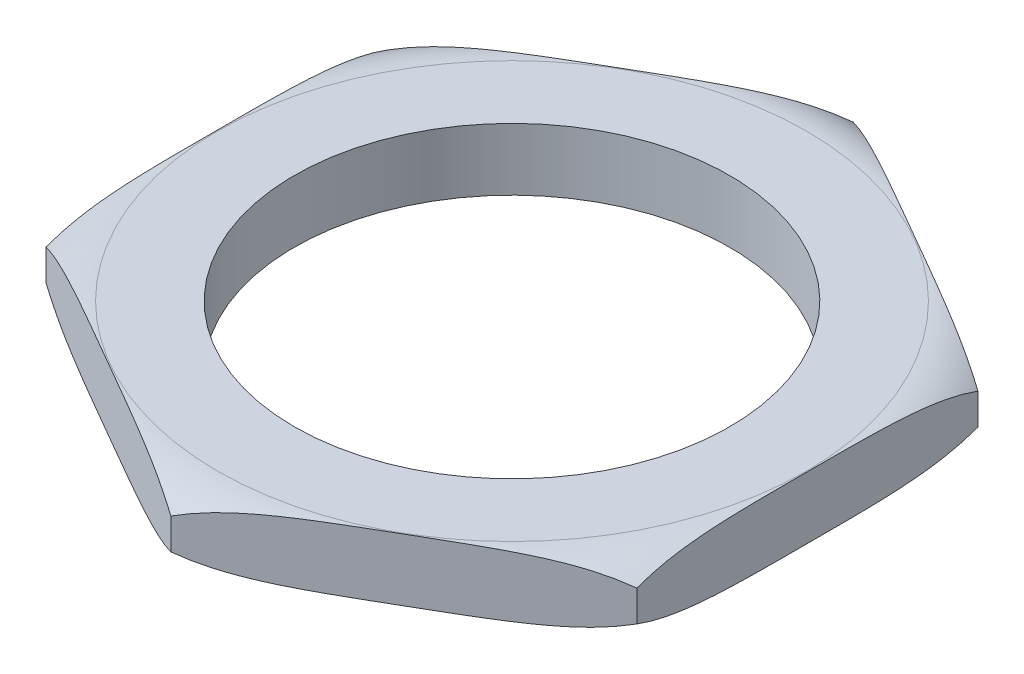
ISO-10303-21;
HEADER;
FILE_DESCRIPTION(('STEP AP214'),'2;1');
FILE_NAME('part.step','',(''),(''),'','','');
FILE_SCHEMA(('AUTOMOTIVE_DESIGN { 1 0 10303 214 1 1 1 1 }'));
ENDSEC;
DATA;
#1=APPLICATION_CONTEXT('core data for automotive mechanical design processes');
#2=APPLICATION_PROTOCOL_DEFINITION('international standard','automotive_design',2000,#1);
#3=PRODUCT_CONTEXT('',#1,'mechanical');
#4=PRODUCT('Part','Part','',(#3));
#5=PRODUCT_RELATED_PRODUCT_CATEGORY('part','',(#4));
#6=PRODUCT_DEFINITION_FORMATION('','',#4);
#7=PRODUCT_DEFINITION_CONTEXT('part definition',#1,'design');
#8=PRODUCT_DEFINITION('design','',#6,#7);
#9=PRODUCT_DEFINITION_SHAPE('','',#8);
#10=(LENGTH_UNIT() NAMED_UNIT(*) SI_UNIT(.MILLI.,.METRE.));
#11=(NAMED_UNIT(*) PLANE_ANGLE_UNIT() SI_UNIT($,.RADIAN.));
#12=(NAMED_UNIT(*) SI_UNIT($,.STERADIAN.) SOLID_ANGLE_UNIT());
#13=UNCERTAINTY_MEASURE_WITH_UNIT(LENGTH_MEASURE(1.E-05),#10,'distance_accuracy_value','');
#14=(GEOMETRIC_REPRESENTATION_CONTEXT(3) GLOBAL_UNCERTAINTY_ASSIGNED_CONTEXT((#13)) GLOBAL_UNIT_ASSIGNED_CONTEXT((#10,
#11,#12)) REPRESENTATION_CONTEXT('',''));
#15=CARTESIAN_POINT('',(0.,0.,0.));
#16=DIRECTION('',(0.,0.,1.));
#17=DIRECTION('',(1.,0.,0.));
#18=AXIS2_PLACEMENT_3D('',#15,#16,#17);
#19=CARTESIAN_POINT('',(0.,4.,0.));
#20=DIRECTION('',(0.,1.,0.));
#21=DIRECTION('',(0.,0.,1.));
#22=AXIS2_PLACEMENT_3D('',#19,#20,#21);
#23=PLANE('',#22);
#24=CARTESIAN_POINT('',(0.,4.,0.));
#25=DIRECTION('',(0.,1.,0.));
#26=DIRECTION('',(0.,0.,1.));
#27=AXIS2_PLACEMENT_3D('',#24,#25,#26);
#28=CIRCLE('',#27,14.);
#29=CARTESIAN_POINT('',(0.,4.,14.));
#30=VERTEX_POINT('',#29);
#31=EDGE_CURVE('E199',#30,#30,#28,.T.);
#32=ORIENTED_EDGE('',*,*,#31,.F.);
#33=EDGE_LOOP('',(#32));
#34=FACE_BOUND('',#33,.T.);
#35=CARTESIAN_POINT('',(0.,4.,0.));
#36=DIRECTION('',(0.,1.,0.));
#37=DIRECTION('',(0.,0.,1.));
#38=AXIS2_PLACEMENT_3D('',#35,#36,#37);
#39=CIRCLE('',#38,18.9393102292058);
#40=CARTESIAN_POINT('',(0.,4.,18.9393102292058));
#41=VERTEX_POINT('',#40);
#42=EDGE_CURVE('E97',#41,#41,#39,.T.);
#43=ORIENTED_EDGE('',*,*,#42,.T.);
#44=EDGE_LOOP('',(#43));
#45=FACE_BOUND('',#44,.T.);
#46=ADVANCED_FACE('F32',(#34,#45),#23,.T.);
#47=CARTESIAN_POINT('',(0.,0.,0.));
#48=DIRECTION('',(0.,1.,0.));
#49=DIRECTION('',(0.,0.,1.));
#50=AXIS2_PLACEMENT_3D('',#47,#48,#49);
#51=PLANE('',#50);
#52=CARTESIAN_POINT('',(0.,0.,0.));
#53=DIRECTION('',(0.,1.,0.));
#54=DIRECTION('',(0.,0.,1.));
#55=AXIS2_PLACEMENT_3D('',#52,#53,#54);
#56=CIRCLE('',#55,18.9393102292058);
#57=CARTESIAN_POINT('',(0.,0.,18.9393102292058));
#58=VERTEX_POINT('',#57);
#59=EDGE_CURVE('E242',#58,#58,#56,.T.);
#60=ORIENTED_EDGE('',*,*,#59,.F.);
#61=EDGE_LOOP('',(#60));
#62=FACE_BOUND('',#61,.T.);
#63=CARTESIAN_POINT('',(0.,0.,0.));
#64=DIRECTION('',(0.,1.,0.));
#65=DIRECTION('',(0.,0.,1.));
#66=AXIS2_PLACEMENT_3D('',#63,#64,#65);
#67=CIRCLE('',#66,14.);
#68=CARTESIAN_POINT('',(0.,0.,14.));
#69=VERTEX_POINT('',#68);
#70=EDGE_CURVE('E198',#69,#69,#67,.T.);
#71=ORIENTED_EDGE('',*,*,#70,.T.);
#72=EDGE_LOOP('',(#71));
#73=FACE_BOUND('',#72,.T.);
#74=ADVANCED_FACE('F231',(#62,#73),#51,.F.);
#75=CARTESIAN_POINT('',(0.,4.,0.));
#76=DIRECTION('',(0.,-1.,0.));
#77=DIRECTION('',(0.,0.,-1.));
#78=AXIS2_PLACEMENT_3D('',#75,#76,#77);
#79=CYLINDRICAL_SURFACE('',#78,14.);
#80=ORIENTED_EDGE('',*,*,#31,.T.);
#81=EDGE_LOOP('',(#80));
#82=FACE_BOUND('',#81,.T.);
#83=ORIENTED_EDGE('',*,*,#70,.F.);
#84=EDGE_LOOP('',(#83));
#85=FACE_BOUND('',#84,.T.);
#86=ADVANCED_FACE('F134',(#82,#85),#79,.F.);
#87=CARTESIAN_POINT('',(0.,5.,0.));
#88=DIRECTION('',(0.,1.,0.));
#89=DIRECTION('',(0.,0.,1.));
#90=AXIS2_PLACEMENT_3D('',#87,#88,#89);
#91=TOROIDAL_SURFACE('',#90,18.9393102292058,5.);
#92=ORIENTED_EDGE('',*,*,#59,.T.);
#93=EDGE_LOOP('',(#92));
#94=FACE_BOUND('',#93,.T.);
#95=CARTESIAN_POINT('',(-0.000200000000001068,1.00008660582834,-21.9394256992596));
#96=CARTESIAN_POINT('',(0.148237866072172,0.93583265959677,-21.8537250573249));
#97=CARTESIAN_POINT('',(0.298156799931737,0.876316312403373,-21.7671693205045));
#98=CARTESIAN_POINT('',(0.60025197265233,0.765860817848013,-21.5927545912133));
#99=CARTESIAN_POINT('',(0.752426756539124,0.714916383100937,-21.5048964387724));
#100=CARTESIAN_POINT('',(1.05804415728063,0.620774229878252,-21.3284481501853));
#101=CARTESIAN_POINT('',(1.2114814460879,0.577553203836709,-21.2398610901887));
#102=CARTESIAN_POINT('',(1.51967527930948,0.497834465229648,-21.0619252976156));
#103=CARTESIAN_POINT('',(1.6744320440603,0.461337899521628,-20.9725764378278));
#104=CARTESIAN_POINT('',(2.14074382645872,0.360638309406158,-20.7033512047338));
#105=CARTESIAN_POINT('',(2.4537639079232,0.30539619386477,-20.5226289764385));
#106=CARTESIAN_POINT('',(2.92482405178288,0.236344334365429,-20.2506622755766));
#107=CARTESIAN_POINT('',(3.08216834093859,0.215622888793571,-20.1598195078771));
#108=CARTESIAN_POINT('',(3.39721719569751,0.178202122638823,-19.9779259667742));
#109=CARTESIAN_POINT('',(3.55492175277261,0.161502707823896,-19.8868751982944));
#110=CARTESIAN_POINT('',(3.95811915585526,0.123257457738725,-19.6540890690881));
#111=CARTESIAN_POINT('',(4.20378424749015,0.104161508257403,-19.5122542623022));
#112=CARTESIAN_POINT('',(4.69543372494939,0.0724347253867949,-19.2284003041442));
#113=CARTESIAN_POINT('',(4.94141813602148,0.0598044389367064,-19.0863811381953));
#114=CARTESIAN_POINT('',(5.43361965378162,0.0393595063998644,-18.8022084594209));
#115=CARTESIAN_POINT('',(5.67983681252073,0.031546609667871,-18.6600549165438));
#116=CARTESIAN_POINT('',(6.17232306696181,0.0193249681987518,-18.37571784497));
#117=CARTESIAN_POINT('',(6.4185921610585,0.0149161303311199,-18.2335343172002));
#118=CARTESIAN_POINT('',(6.91141536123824,0.00831724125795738,-17.9490027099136));
#119=CARTESIAN_POINT('',(7.15796948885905,0.00612958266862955,-17.8066546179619));
#120=CARTESIAN_POINT('',(7.65108384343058,0.00304586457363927,-17.5219549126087));
#121=CARTESIAN_POINT('',(7.89764407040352,0.00214981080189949,-17.3796032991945));
#122=CARTESIAN_POINT('',(8.3907036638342,0.000979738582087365,-17.0949352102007));
#123=CARTESIAN_POINT('',(8.63720303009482,0.000705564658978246,-16.9526187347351));
#124=CARTESIAN_POINT('',(9.13020105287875,0.000390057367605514,-16.6679861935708));
#125=CARTESIAN_POINT('',(9.37669970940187,0.000348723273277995,-16.5256701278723));
#126=CARTESIAN_POINT('',(9.86954144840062,0.000400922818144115,-16.2411278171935));
#127=CARTESIAN_POINT('',(10.1158845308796,0.000494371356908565,-16.0989015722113));
#128=CARTESIAN_POINT('',(10.6085714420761,0.00101111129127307,-15.8144486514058));
#129=CARTESIAN_POINT('',(10.854915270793,0.00143440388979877,-15.6722219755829));
#130=CARTESIAN_POINT('',(11.3476691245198,0.00309350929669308,-15.3877304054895));
#131=CARTESIAN_POINT('',(11.594079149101,0.00432954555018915,-15.2454655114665));
#132=CARTESIAN_POINT('',(12.0868896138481,0.0083725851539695,-14.9609412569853));
#133=CARTESIAN_POINT('',(12.3332900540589,0.0111795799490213,-14.8186818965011));
#134=CARTESIAN_POINT('',(12.8257539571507,0.0193774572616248,-14.5343577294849));
#135=CARTESIAN_POINT('',(13.0718174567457,0.0247651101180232,-14.392292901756));
#136=CARTESIAN_POINT('',(13.5638723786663,0.0393810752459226,-14.1082048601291));
#137=CARTESIAN_POINT('',(13.8098637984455,0.048609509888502,-13.9661816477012));
#138=CARTESIAN_POINT('',(14.3015568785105,0.0723941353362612,-13.682302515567));
#139=CARTESIAN_POINT('',(14.5472586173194,0.0869480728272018,-13.5404465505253));
#140=CARTESIAN_POINT('',(15.038265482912,0.123103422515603,-13.2569636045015));
#141=CARTESIAN_POINT('',(15.2835706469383,0.144704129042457,-13.1153366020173));
#142=CARTESIAN_POINT('',(15.6760887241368,0.186541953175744,-12.888716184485));
#143=CARTESIAN_POINT('',(15.8235296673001,0.203907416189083,-12.80359111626));
#144=CARTESIAN_POINT('',(16.1180430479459,0.242391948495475,-12.6335537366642));
#145=CARTESIAN_POINT('',(16.2651154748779,0.263511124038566,-12.5486414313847));
#146=CARTESIAN_POINT('',(16.7054164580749,0.333225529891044,-12.2944335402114));
#147=CARTESIAN_POINT('',(16.9979433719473,0.388199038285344,-12.125543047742));
#148=CARTESIAN_POINT('',(17.4338057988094,0.486808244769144,-11.8738977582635));
#149=CARTESIAN_POINT('',(17.5785294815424,0.52234640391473,-11.7903415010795));
#150=CARTESIAN_POINT('',(17.8667542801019,0.599460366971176,-11.6239348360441));
#151=CARTESIAN_POINT('',(18.0102555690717,0.64103530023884,-11.5410843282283));
#152=CARTESIAN_POINT('',(18.296062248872,0.73103355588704,-11.3760737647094));
#153=CARTESIAN_POINT('',(18.438363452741,0.779474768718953,-11.2939161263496));
#154=CARTESIAN_POINT('',(18.7209453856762,0.883918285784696,-11.1307673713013));
#155=CARTESIAN_POINT('',(18.861225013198,0.93992455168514,-11.0497768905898));
#156=CARTESIAN_POINT('',(19.0002,1.00008660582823,-10.9695396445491));
#157=B_SPLINE_CURVE_WITH_KNOTS('',3,(#95,#96,#97,#98,#99,#100,#101,#102,#103,#104,#105,#106,
#107,#108,#109,#110,#111,#112,#113,#114,#115,#116,#117,#118,#119,#120,#121,#122,#123,#124,#125,
#126,#127,#128,#129,#130,#131,#132,#133,#134,#135,#136,#137,#138,#139,#140,#141,#142,#143,#144,
#145,#146,#147,#148,#149,#150,#151,#152,#153,#154,#155,#156),.UNSPECIFIED.,.F.,.F.,(4,2,2,2,2,2,
2,2,2,2,2,2,2,2,2,2,2,2,2,2,2,2,2,2,2,2,2,2,2,2,4),(0.,0.548988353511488,1.09763682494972,
1.6446005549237,2.1916574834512,3.28782837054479,3.83639446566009,4.38494770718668,
5.23778011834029,6.09068465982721,6.94389873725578,7.79708947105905,8.65119827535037,
9.50531087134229,10.3592099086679,11.2131062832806,12.0664637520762,12.9198243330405,
13.7734196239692,14.627010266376,15.4795354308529,16.3320877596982,17.1842797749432,
18.0363864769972,18.5497465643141,19.0631211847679,20.0891247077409,20.6015844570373,
21.1139703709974,21.6277167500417,22.1417332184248),.UNSPECIFIED.);
#158=CARTESIAN_POINT('',(0.,0.99999999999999,-21.9393102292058));
#159=VERTEX_POINT('',#158);
#160=CARTESIAN_POINT('',(19.,1.,-10.9696551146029));
#161=VERTEX_POINT('',#160);
#162=EDGE_CURVE('E60',#159,#161,#157,.T.);
#163=ORIENTED_EDGE('',*,*,#162,.T.);
#164=CARTESIAN_POINT('',(19.,0.000368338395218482,0.));
#165=CARTESIAN_POINT('',(19.,0.000363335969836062,0.421055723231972));
#166=CARTESIAN_POINT('',(19.,0.000478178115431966,0.842111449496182));
#167=CARTESIAN_POINT('',(19.,0.00162875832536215,1.68423710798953));
#168=CARTESIAN_POINT('',(19.,0.00266452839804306,2.10530704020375));
#169=CARTESIAN_POINT('',(19.,0.00773584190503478,2.94840806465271));
#170=CARTESIAN_POINT('',(19.,0.0117783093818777,3.37043913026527));
#171=CARTESIAN_POINT('',(19.,0.0262219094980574,4.2143811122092));
#172=CARTESIAN_POINT('',(19.,0.0366225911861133,4.63629203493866));
#173=CARTESIAN_POINT('',(19.,0.068113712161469,5.47464152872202));
#174=CARTESIAN_POINT('',(19.,0.0890730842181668,5.89108445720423));
#175=CARTESIAN_POINT('',(19.,0.147064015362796,6.72306356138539));
#176=CARTESIAN_POINT('',(19.,0.184101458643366,7.13859934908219));
#177=CARTESIAN_POINT('',(19.,0.280647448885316,7.96556310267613));
#178=CARTESIAN_POINT('',(19.,0.340065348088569,8.37700085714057));
#179=CARTESIAN_POINT('',(19.,0.451911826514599,8.98984084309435));
#180=CARTESIAN_POINT('',(19.,0.492960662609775,9.1933248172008));
#181=CARTESIAN_POINT('',(19.,0.583773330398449,9.59832433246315));
#182=CARTESIAN_POINT('',(19.,0.633535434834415,9.7998402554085));
#183=CARTESIAN_POINT('',(19.,0.734266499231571,10.1681930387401));
#184=CARTESIAN_POINT('',(19.,0.783773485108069,10.335428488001));
#185=CARTESIAN_POINT('',(19.,0.890634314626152,10.6674539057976));
#186=CARTESIAN_POINT('',(19.,0.947990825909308,10.8322430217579));
#187=CARTESIAN_POINT('',(19.,1.07156815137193,11.1590020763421));
#188=CARTESIAN_POINT('',(19.,1.13781274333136,11.3209630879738));
#189=CARTESIAN_POINT('',(19.,1.2799543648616,11.6405924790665));
#190=CARTESIAN_POINT('',(19.,1.3558504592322,11.7982612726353));
#191=CARTESIAN_POINT('',(19.,1.51932628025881,12.1100598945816));
#192=CARTESIAN_POINT('',(19.,1.6070420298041,12.2641194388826));
#193=CARTESIAN_POINT('',(19.,1.79431227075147,12.564814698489));
#194=CARTESIAN_POINT('',(19.,1.8938696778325,12.7114485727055));
#195=CARTESIAN_POINT('',(19.,2.21128214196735,13.1362340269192));
#196=CARTESIAN_POINT('',(19.,2.44866557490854,13.4008519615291));
#197=CARTESIAN_POINT('',(19.,2.86602607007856,13.7690332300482));
#198=CARTESIAN_POINT('',(19.,3.0278164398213,13.8933771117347));
#199=CARTESIAN_POINT('',(19.,3.36908348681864,14.1154753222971));
#200=CARTESIAN_POINT('',(19.,3.54855016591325,14.2132445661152));
#201=CARTESIAN_POINT('',(19.,3.82935424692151,14.3354068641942));
#202=CARTESIAN_POINT('',(19.,3.92542904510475,14.3721739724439));
#203=CARTESIAN_POINT('',(19.,4.12058861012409,14.4365273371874));
#204=CARTESIAN_POINT('',(19.,4.21967176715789,14.4641184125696));
#205=CARTESIAN_POINT('',(19.,4.42001526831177,14.5094878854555));
#206=CARTESIAN_POINT('',(19.,4.521274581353,14.5272708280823));
#207=CARTESIAN_POINT('',(19.,4.7250615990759,14.5526136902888));
#208=CARTESIAN_POINT('',(19.,4.82758912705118,14.5601750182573));
#209=CARTESIAN_POINT('',(19.,5.01985342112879,14.5645854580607));
#210=CARTESIAN_POINT('',(19.,5.10956315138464,14.5626716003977));
#211=CARTESIAN_POINT('',(19.,5.28847432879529,14.5509592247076));
#212=CARTESIAN_POINT('',(19.,5.37767560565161,14.5411582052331));
#213=CARTESIAN_POINT('',(19.,5.64341391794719,14.5001494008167));
#214=CARTESIAN_POINT('',(19.,5.81828391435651,14.4573398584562));
#215=CARTESIAN_POINT('',(19.,6.15387983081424,14.345337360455));
#216=CARTESIAN_POINT('',(19.,6.31485968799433,14.2768850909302));
#217=CARTESIAN_POINT('',(19.,6.62515429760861,14.117439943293));
#218=CARTESIAN_POINT('',(19.,6.77446510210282,14.0264394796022));
#219=CARTESIAN_POINT('',(19.,7.13076910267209,13.7761937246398));
#220=CARTESIAN_POINT('',(19.,7.32969942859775,13.6054720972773));
#221=CARTESIAN_POINT('',(19.,7.69787112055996,13.2344244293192));
#222=CARTESIAN_POINT('',(19.,7.86703436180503,13.0340229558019));
#223=CARTESIAN_POINT('',(19.,8.14215878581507,12.6608666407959));
#224=CARTESIAN_POINT('',(19.,8.2537481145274,12.4921713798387));
#225=CARTESIAN_POINT('',(19.,8.46177905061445,12.1456043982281));
#226=CARTESIAN_POINT('',(19.,8.55821163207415,11.9677272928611));
#227=CARTESIAN_POINT('',(19.,8.73739481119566,11.6051384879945));
#228=CARTESIAN_POINT('',(19.,8.82013666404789,11.4204225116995));
#229=CARTESIAN_POINT('',(19.,8.97332042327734,11.0460497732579));
#230=CARTESIAN_POINT('',(19.,9.0437648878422,10.8563940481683));
#231=CARTESIAN_POINT('',(19.,9.18889619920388,10.4288209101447));
#232=CARTESIAN_POINT('',(19.,9.26075243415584,10.189947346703));
#233=CARTESIAN_POINT('',(19.,9.39028818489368,9.70834320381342));
#234=CARTESIAN_POINT('',(19.,9.44796176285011,9.46561105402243));
#235=CARTESIAN_POINT('',(19.,9.55129296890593,8.97721976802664));
#236=CARTESIAN_POINT('',(19.,9.59693075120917,8.73155648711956));
#237=CARTESIAN_POINT('',(19.,9.67795309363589,8.23860427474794));
#238=CARTESIAN_POINT('',(19.,9.71333895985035,7.99131555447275));
#239=CARTESIAN_POINT('',(19.,9.7757514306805,7.49412378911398));
#240=CARTESIAN_POINT('',(19.,9.80272404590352,7.24421408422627));
#241=CARTESIAN_POINT('',(19.,9.84954675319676,6.7437352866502));
#242=CARTESIAN_POINT('',(19.,9.86939663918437,6.49316617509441));
#243=CARTESIAN_POINT('',(19.,9.90333700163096,5.99186490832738));
#244=CARTESIAN_POINT('',(19.,9.91743242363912,5.74113307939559));
#245=CARTESIAN_POINT('',(19.,9.94110636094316,5.23946770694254));
#246=CARTESIAN_POINT('',(19.,9.95068495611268,4.98853416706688));
#247=CARTESIAN_POINT('',(19.,9.9728611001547,4.28150872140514));
#248=CARTESIAN_POINT('',(19.,9.98153145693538,3.82529894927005));
#249=CARTESIAN_POINT('',(19.,9.99293535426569,2.91280305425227));
#250=CARTESIAN_POINT('',(19.,9.99566849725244,2.45651692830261));
#251=CARTESIAN_POINT('',(19.,9.99884044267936,1.54368809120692));
#252=CARTESIAN_POINT('',(19.,9.99927798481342,1.08714537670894));
#253=CARTESIAN_POINT('',(19.,9.99970944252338,0.174082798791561));
#254=CARTESIAN_POINT('',(19.,9.99970337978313,-0.282437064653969));
#255=CARTESIAN_POINT('',(19.,9.99916945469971,-1.19628692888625));
#256=CARTESIAN_POINT('',(19.,9.99864066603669,-1.65361692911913));
#257=CARTESIAN_POINT('',(19.,9.99504914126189,-2.56831430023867));
#258=CARTESIAN_POINT('',(19.,9.99198618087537,-3.02568167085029));
#259=CARTESIAN_POINT('',(19.,9.97950719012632,-3.93998719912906));
#260=CARTESIAN_POINT('',(19.,9.97009612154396,-4.39692541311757));
#261=CARTESIAN_POINT('',(19.,9.939489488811,-5.31040151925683));
#262=CARTESIAN_POINT('',(19.,9.91829605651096,-5.76693946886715));
#263=CARTESIAN_POINT('',(19.,9.87208178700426,-6.45540507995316));
#264=CARTESIAN_POINT('',(19.,9.85402311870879,-6.68779334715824));
#265=CARTESIAN_POINT('',(19.,9.81189819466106,-7.15201818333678));
#266=CARTESIAN_POINT('',(19.,9.78783238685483,-7.38385479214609));
#267=CARTESIAN_POINT('',(19.,9.73245370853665,-7.8469705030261));
#268=CARTESIAN_POINT('',(19.,9.70113174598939,-8.07824853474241));
#269=CARTESIAN_POINT('',(19.,9.62991033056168,-8.53948870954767));
#270=CARTESIAN_POINT('',(19.,9.59001125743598,-8.76945091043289));
#271=CARTESIAN_POINT('',(19.,9.50061657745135,-9.22498920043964));
#272=CARTESIAN_POINT('',(19.,9.45122743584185,-9.45058593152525));
#273=CARTESIAN_POINT('',(19.,9.34096562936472,-9.89903434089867));
#274=CARTESIAN_POINT('',(19.,9.28009087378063,-10.1218855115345));
#275=CARTESIAN_POINT('',(19.,9.14523374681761,-10.5630562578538));
#276=CARTESIAN_POINT('',(19.,9.07128232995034,-10.7813852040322));
#277=CARTESIAN_POINT('',(19.,8.90825107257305,-11.2122591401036));
#278=CARTESIAN_POINT('',(19.,8.81918047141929,-11.4248075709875));
#279=CARTESIAN_POINT('',(19.,8.65266590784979,-11.7801893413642));
#280=CARTESIAN_POINT('',(19.,8.57956748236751,-11.9250588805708));
#281=CARTESIAN_POINT('',(19.,8.42401233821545,-12.2097440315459));
#282=CARTESIAN_POINT('',(19.,8.34155441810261,-12.349558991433));
#283=CARTESIAN_POINT('',(19.,8.16652741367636,-12.6227395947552));
#284=CARTESIAN_POINT('',(19.,8.07395942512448,-12.7561059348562));
#285=CARTESIAN_POINT('',(19.,7.87806086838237,-13.0146220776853));
#286=CARTESIAN_POINT('',(19.,7.77473465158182,-13.1397751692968));
#287=CARTESIAN_POINT('',(19.,7.51296973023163,-13.428006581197));
#288=CARTESIAN_POINT('',(19.,7.3490315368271,-13.5862004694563));
#289=CARTESIAN_POINT('',(19.,6.9984795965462,-13.8750697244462));
#290=CARTESIAN_POINT('',(19.,6.81190043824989,-14.0057862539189));
#291=CARTESIAN_POINT('',(19.,6.45327318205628,-14.210991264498));
#292=CARTESIAN_POINT('',(19.,6.28461272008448,-14.2913581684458));
#293=CARTESIAN_POINT('',(19.,5.93621372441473,-14.4229590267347));
#294=CARTESIAN_POINT('',(19.,5.75648191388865,-14.4742104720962));
#295=CARTESIAN_POINT('',(19.,5.38974756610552,-14.5439795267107));
#296=CARTESIAN_POINT('',(19.,5.20271336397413,-14.5623333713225));
#297=CARTESIAN_POINT('',(19.,4.82847439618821,-14.5642462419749));
#298=CARTESIAN_POINT('',(19.,4.64126965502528,-14.5478096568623));
#299=CARTESIAN_POINT('',(19.,4.28777508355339,-14.4842307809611));
#300=CARTESIAN_POINT('',(19.,4.12101161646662,-14.4396554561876));
#301=CARTESIAN_POINT('',(19.,3.79649404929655,-14.3251895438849));
#302=CARTESIAN_POINT('',(19.,3.63874274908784,-14.2552911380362));
#303=CARTESIAN_POINT('',(19.,3.28303383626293,-14.0663803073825));
#304=CARTESIAN_POINT('',(19.,3.08965498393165,-13.9387490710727));
#305=CARTESIAN_POINT('',(19.,2.72618795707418,-13.6538609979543));
#306=CARTESIAN_POINT('',(19.,2.55614523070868,-13.4965477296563));
#307=CARTESIAN_POINT('',(19.,2.1675888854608,-13.0841416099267));
#308=CARTESIAN_POINT('',(19.,1.96189092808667,-12.8169854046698));
#309=CARTESIAN_POINT('',(19.,1.68634178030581,-12.3954464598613));
#310=CARTESIAN_POINT('',(19.,1.59989907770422,-12.2512610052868));
#311=CARTESIAN_POINT('',(19.,1.43709261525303,-11.957292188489));
#312=CARTESIAN_POINT('',(19.,1.36072716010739,-11.807509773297));
#313=CARTESIAN_POINT('',(19.,1.16304789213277,-11.388861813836));
#314=CARTESIAN_POINT('',(19.,1.05132907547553,-11.1154694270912));
#315=CARTESIAN_POINT('',(19.,0.851854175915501,-10.5600338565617));
#316=CARTESIAN_POINT('',(19.,0.764118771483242,-10.277983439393));
#317=CARTESIAN_POINT('',(19.,0.608607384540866,-9.70804064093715));
#318=CARTESIAN_POINT('',(19.,0.540863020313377,-9.42013976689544));
#319=CARTESIAN_POINT('',(19.,0.422048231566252,-8.84112079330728));
#320=CARTESIAN_POINT('',(19.,0.370970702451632,-8.55000411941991));
#321=CARTESIAN_POINT('',(19.,0.27519255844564,-7.91833258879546));
#322=CARTESIAN_POINT('',(19.,0.232872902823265,-7.57742335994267));
#323=CARTESIAN_POINT('',(19.,0.162391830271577,-6.89411412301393));
#324=CARTESIAN_POINT('',(19.,0.134234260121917,-6.55171373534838));
#325=CARTESIAN_POINT('',(19.,0.0884958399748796,-5.86580428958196));
#326=CARTESIAN_POINT('',(19.,0.0709284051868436,-5.52229437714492));
#327=CARTESIAN_POINT('',(19.,0.0433670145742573,-4.83502320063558));
#328=CARTESIAN_POINT('',(19.,0.0333723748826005,-4.49126196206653));
#329=CARTESIAN_POINT('',(19.,0.0183503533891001,-3.80170262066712));
#330=CARTESIAN_POINT('',(19.,0.0133512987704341,-3.45590396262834));
#331=CARTESIAN_POINT('',(19.,0.00633089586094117,-2.76427582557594));
#332=CARTESIAN_POINT('',(19.,0.00430959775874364,-2.41844634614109));
#333=CARTESIAN_POINT('',(19.,0.0017072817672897,-1.7271780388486));
#334=CARTESIAN_POINT('',(19.,0.00112462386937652,-1.38173921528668));
#335=CARTESIAN_POINT('',(19.,0.000457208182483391,-0.690866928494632));
#336=CARTESIAN_POINT('',(19.,0.00037244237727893,-0.345433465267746));
#337=CARTESIAN_POINT('',(19.,0.000368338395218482,0.));
#338=B_SPLINE_CURVE_WITH_KNOTS('',3,(#164,#165,#166,#167,#168,#169,#170,#171,#172,#173,#174,
#175,#176,#177,#178,#179,#180,#181,#182,#183,#184,#185,#186,#187,#188,#189,#190,#191,#192,#193,
#194,#195,#196,#197,#198,#199,#200,#201,#202,#203,#204,#205,#206,#207,#208,#209,#210,#211,#212,
#213,#214,#215,#216,#217,#218,#219,#220,#221,#222,#223,#224,#225,#226,#227,#228,#229,#230,#231,
#232,#233,#234,#235,#236,#237,#238,#239,#240,#241,#242,#243,#244,#245,#246,#247,#248,#249,#250,
#251,#252,#253,#254,#255,#256,#257,#258,#259,#260,#261,#262,#263,#264,#265,#266,#267,#268,#269,
#270,#271,#272,#273,#274,#275,#276,#277,#278,#279,#280,#281,#282,#283,#284,#285,#286,#287,#288,
#289,#290,#291,#292,#293,#294,#295,#296,#297,#298,#299,#300,#301,#302,#303,#304,#305,#306,#307,
#308,#309,#310,#311,#312,#313,#314,#315,#316,#317,#318,#319,#320,#321,#322,#323,#324,#325,#326,
#327,#328,#329,#330,#331,#332,#333,#334,#335,#336,#337),.UNSPECIFIED.,.T.,.F.,(4,2,2,2,2,2,2,2,
2,2,2,2,2,2,2,2,2,2,2,2,2,2,2,2,2,2,2,2,2,2,2,2,2,2,2,2,2,2,2,2,2,2,2,2,2,2,2,2,2,2,2,2,2,2,2,2,
2,2,2,2,2,2,2,2,2,2,2,2,2,2,2,2,2,2,2,2,2,2,2,2,2,2,2,2,2,2,4),(0.,1.26316714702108,
2.52637819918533,3.79250730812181,5.05854662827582,6.30924391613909,7.56039931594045,
8.80654071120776,9.42913794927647,10.0516119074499,10.5746730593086,11.0979124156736,
11.6225805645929,12.1471979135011,12.6784715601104,13.209876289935,14.2674396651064,
14.8776920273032,15.4876011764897,15.7958335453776,16.1039037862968,16.4118311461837,
16.7197160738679,16.9885508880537,17.2574709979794,17.7947238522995,18.3175247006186,
18.8405016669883,19.6225306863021,20.4065825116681,21.0125447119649,21.6188664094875,
22.2255739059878,22.832155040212,23.5799576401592,24.3280727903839,25.0774139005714,
25.8266595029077,26.5806186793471,27.3345996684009,28.0879312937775,28.8412495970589,
30.2100331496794,31.5789083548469,32.9485350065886,34.3180947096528,35.6900857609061,
37.0621982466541,38.4332395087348,39.8040327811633,40.5032378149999,41.2023907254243,
41.9024244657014,42.6024272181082,43.2949925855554,43.9876841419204,44.6787574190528,
45.3694098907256,45.8559149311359,46.3424824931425,46.828997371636,47.3153162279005,
47.9963971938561,48.676450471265,49.2346375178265,49.7924888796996,50.353109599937,
50.9136596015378,51.429276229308,51.9450521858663,52.6362907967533,53.3288570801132,
54.3343586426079,54.8384478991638,55.342452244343,56.2269855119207,57.1122790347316,
57.998965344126,58.885273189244,59.9154495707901,60.9459056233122,61.9776642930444,
63.0093297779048,64.0468126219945,65.08431295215,66.1206300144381,67.1569303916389),.UNSPECIFIED.);
#339=CARTESIAN_POINT('',(19.,0.999999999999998,10.9696551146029));
#340=VERTEX_POINT('',#339);
#341=EDGE_CURVE('E46',#161,#340,#338,.T.);
#342=ORIENTED_EDGE('',*,*,#341,.T.);
#343=CARTESIAN_POINT('',(19.0002,1.00008660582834,10.9695396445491));
#344=CARTESIAN_POINT('',(18.8517621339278,0.935832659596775,11.0552402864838));
#345=CARTESIAN_POINT('',(18.7018432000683,0.876316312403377,11.1417960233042));
#346=CARTESIAN_POINT('',(18.3997480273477,0.765860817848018,11.3162107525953));
#347=CARTESIAN_POINT('',(18.2475732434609,0.714916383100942,11.4040689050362));
#348=CARTESIAN_POINT('',(17.9419558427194,0.620774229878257,11.5805171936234));
#349=CARTESIAN_POINT('',(17.7885185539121,0.577553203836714,11.66910425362));
#350=CARTESIAN_POINT('',(17.4803247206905,0.497834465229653,11.847040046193));
#351=CARTESIAN_POINT('',(17.3255679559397,0.461337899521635,11.9363889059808));
#352=CARTESIAN_POINT('',(16.8592561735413,0.360638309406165,12.2056141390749));
#353=CARTESIAN_POINT('',(16.5462360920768,0.305396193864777,12.3863363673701));
#354=CARTESIAN_POINT('',(16.0751759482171,0.236344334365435,12.658303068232));
#355=CARTESIAN_POINT('',(15.9178316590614,0.215622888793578,12.7491458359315));
#356=CARTESIAN_POINT('',(15.6027828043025,0.17820212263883,12.9310393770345));
#357=CARTESIAN_POINT('',(15.4450782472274,0.161502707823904,13.0220901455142));
#358=CARTESIAN_POINT('',(15.0418808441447,0.123257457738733,13.2548762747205));
#359=CARTESIAN_POINT('',(14.7962157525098,0.10416150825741,13.3967110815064));
#360=CARTESIAN_POINT('',(14.3045662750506,0.072434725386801,13.6805650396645));
#361=CARTESIAN_POINT('',(14.0585818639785,0.0598044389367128,13.8225842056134));
#362=CARTESIAN_POINT('',(13.5663803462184,0.039359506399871,14.1067568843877));
#363=CARTESIAN_POINT('',(13.3201631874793,0.0315466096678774,14.2489104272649));
#364=CARTESIAN_POINT('',(12.8276769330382,0.0193249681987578,14.5332474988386));
#365=CARTESIAN_POINT('',(12.5814078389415,0.0149161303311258,14.6754310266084));
#366=CARTESIAN_POINT('',(12.0885846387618,0.00831724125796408,14.9599626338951));
#367=CARTESIAN_POINT('',(11.8420305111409,0.00612958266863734,15.1023107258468));
#368=CARTESIAN_POINT('',(11.3489161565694,0.00304586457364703,15.3870104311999));
#369=CARTESIAN_POINT('',(11.1023559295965,0.00214981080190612,15.5293620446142));
#370=CARTESIAN_POINT('',(10.6092963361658,0.000979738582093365,15.8140301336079));
#371=CARTESIAN_POINT('',(10.3627969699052,0.000705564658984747,15.9563466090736));
#372=CARTESIAN_POINT('',(9.86979894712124,0.000390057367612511,16.2409791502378));
#373=CARTESIAN_POINT('',(9.62330029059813,0.000348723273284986,16.3832952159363));
#374=CARTESIAN_POINT('',(9.13045855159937,0.000400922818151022,16.6678375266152));
#375=CARTESIAN_POINT('',(8.88411546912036,0.000494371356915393,16.8100637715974));
#376=CARTESIAN_POINT('',(8.39142855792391,0.00101111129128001,17.0945166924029));
#377=CARTESIAN_POINT('',(8.14508472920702,0.00143440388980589,17.2367433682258));
#378=CARTESIAN_POINT('',(7.65233087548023,0.00309350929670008,17.5212349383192));
#379=CARTESIAN_POINT('',(7.40592085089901,0.00432954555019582,17.6634998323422));
#380=CARTESIAN_POINT('',(6.91311038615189,0.00837258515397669,17.9480240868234));
#381=CARTESIAN_POINT('',(6.6667099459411,0.0111795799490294,18.0902834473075));
#382=CARTESIAN_POINT('',(6.17424604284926,0.0193774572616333,18.3746076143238));
#383=CARTESIAN_POINT('',(5.92818254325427,0.0247651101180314,18.5166724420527));
#384=CARTESIAN_POINT('',(5.43612762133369,0.0393810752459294,18.8007604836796));
#385=CARTESIAN_POINT('',(5.19013620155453,0.0486095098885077,18.9427836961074));
#386=CARTESIAN_POINT('',(4.69844312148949,0.0723941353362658,19.2266628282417));
#387=CARTESIAN_POINT('',(4.45274138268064,0.0869480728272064,19.3685187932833));
#388=CARTESIAN_POINT('',(3.961734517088,0.123103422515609,19.6520017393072));
#389=CARTESIAN_POINT('',(3.71642935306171,0.144704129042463,19.7936287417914));
#390=CARTESIAN_POINT('',(3.32391127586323,0.18654195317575,20.0202491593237));
#391=CARTESIAN_POINT('',(3.17647033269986,0.203907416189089,20.1053742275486));
#392=CARTESIAN_POINT('',(2.88195695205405,0.24239194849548,20.2754116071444));
#393=CARTESIAN_POINT('',(2.73488452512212,0.263511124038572,20.360323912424));
#394=CARTESIAN_POINT('',(2.29458354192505,0.33322552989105,20.6145318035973));
#395=CARTESIAN_POINT('',(2.00205662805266,0.388199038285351,20.7834222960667));
#396=CARTESIAN_POINT('',(1.56619420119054,0.48680824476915,21.0350675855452));
#397=CARTESIAN_POINT('',(1.42147051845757,0.522346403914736,21.1186238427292));
#398=CARTESIAN_POINT('',(1.13324571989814,0.599460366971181,21.2850305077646));
#399=CARTESIAN_POINT('',(0.989744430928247,0.641035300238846,21.3678810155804));
#400=CARTESIAN_POINT('',(0.703937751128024,0.731033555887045,21.5328915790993));
#401=CARTESIAN_POINT('',(0.561636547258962,0.779474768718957,21.6150492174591));
#402=CARTESIAN_POINT('',(0.279054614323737,0.8839182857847,21.7781979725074));
#403=CARTESIAN_POINT('',(0.13877498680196,0.939924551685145,21.8591884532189));
#404=CARTESIAN_POINT('',(-0.000200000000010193,1.00008660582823,21.9394256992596));
#405=B_SPLINE_CURVE_WITH_KNOTS('',3,(#343,#344,#345,#346,#347,#348,#349,#350,#351,#352,#353,
#354,#355,#356,#357,#358,#359,#360,#361,#362,#363,#364,#365,#366,#367,#368,#369,#370,#371,#372,
#373,#374,#375,#376,#377,#378,#379,#380,#381,#382,#383,#384,#385,#386,#387,#388,#389,#390,#391,
#392,#393,#394,#395,#396,#397,#398,#399,#400,#401,#402,#403,#404),.UNSPECIFIED.,.F.,.F.,(4,2,2,
2,2,2,2,2,2,2,2,2,2,2,2,2,2,2,2,2,2,2,2,2,2,2,2,2,2,2,4),(0.,0.548988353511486,1.09763682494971,
1.64460055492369,2.1916574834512,3.28782837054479,3.83639446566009,4.38494770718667,
5.23778011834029,6.0906846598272,6.94389873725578,7.79708947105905,8.65119827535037,
9.50531087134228,10.3592099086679,11.2131062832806,12.0664637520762,12.9198243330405,
13.7734196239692,14.627010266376,15.4795354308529,16.3320877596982,17.1842797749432,
18.0363864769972,18.5497465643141,19.0631211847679,20.0891247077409,20.6015844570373,
21.1139703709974,21.6277167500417,22.1417332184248),.UNSPECIFIED.);
#406=CARTESIAN_POINT('',(0.,1.,21.9393102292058));
#407=VERTEX_POINT('',#406);
#408=EDGE_CURVE('E88',#340,#407,#405,.T.);
#409=ORIENTED_EDGE('',*,*,#408,.T.);
#410=CARTESIAN_POINT('',(0.000199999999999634,1.00008660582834,21.9394256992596));
#411=CARTESIAN_POINT('',(-0.148237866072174,0.935832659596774,21.8537250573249));
#412=CARTESIAN_POINT('',(-0.298156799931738,0.876316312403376,21.7671693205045));
#413=CARTESIAN_POINT('',(-0.600251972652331,0.765860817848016,21.5927545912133));
#414=CARTESIAN_POINT('',(-0.752426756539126,0.71491638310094,21.5048964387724));
#415=CARTESIAN_POINT('',(-1.05804415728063,0.620774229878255,21.3284481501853));
#416=CARTESIAN_POINT('',(-1.21148144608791,0.577553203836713,21.2398610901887));
#417=CARTESIAN_POINT('',(-1.51967527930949,0.497834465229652,21.0619252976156));
#418=CARTESIAN_POINT('',(-1.6744320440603,0.461337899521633,20.9725764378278));
#419=CARTESIAN_POINT('',(-2.14074382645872,0.360638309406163,20.7033512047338));
#420=CARTESIAN_POINT('',(-2.45376390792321,0.305396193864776,20.5226289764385));
#421=CARTESIAN_POINT('',(-2.92482405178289,0.236344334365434,20.2506622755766));
#422=CARTESIAN_POINT('',(-3.0821683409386,0.215622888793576,20.1598195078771));
#423=CARTESIAN_POINT('',(-3.39721719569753,0.178202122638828,19.9779259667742));
#424=CARTESIAN_POINT('',(-3.55492175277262,0.161502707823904,19.8868751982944));
#425=CARTESIAN_POINT('',(-3.95811915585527,0.123257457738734,19.6540890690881));
#426=CARTESIAN_POINT('',(-4.20378424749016,0.10416150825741,19.5122542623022));
#427=CARTESIAN_POINT('',(-4.6954337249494,0.0724347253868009,19.2284003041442));
#428=CARTESIAN_POINT('',(-4.94141813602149,0.0598044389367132,19.0863811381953));
#429=CARTESIAN_POINT('',(-5.43361965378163,0.0393595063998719,18.8022084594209));
#430=CARTESIAN_POINT('',(-5.67983681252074,0.0315466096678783,18.6600549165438));
#431=CARTESIAN_POINT('',(-6.17232306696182,0.0193249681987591,18.37571784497));
#432=CARTESIAN_POINT('',(-6.4185921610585,0.0149161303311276,18.2335343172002));
#433=CARTESIAN_POINT('',(-6.91141536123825,0.00831724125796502,17.9490027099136));
#434=CARTESIAN_POINT('',(-7.15796948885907,0.00612958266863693,17.8066546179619));
#435=CARTESIAN_POINT('',(-7.6510838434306,0.00304586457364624,17.5219549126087));
#436=CARTESIAN_POINT('',(-7.89764407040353,0.00214981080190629,17.3796032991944));
#437=CARTESIAN_POINT('',(-8.39070366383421,0.000979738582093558,17.0949352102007));
#438=CARTESIAN_POINT('',(-8.63720303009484,0.000705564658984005,16.9526187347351));
#439=CARTESIAN_POINT('',(-9.13020105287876,0.000390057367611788,16.6679861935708));
#440=CARTESIAN_POINT('',(-9.37669970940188,0.000348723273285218,16.5256701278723));
#441=CARTESIAN_POINT('',(-9.86954144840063,0.000400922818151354,16.2411278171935));
#442=CARTESIAN_POINT('',(-10.1158845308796,0.000494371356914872,16.0989015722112));
#443=CARTESIAN_POINT('',(-10.6085714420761,0.00101111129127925,15.8144486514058));
#444=CARTESIAN_POINT('',(-10.854915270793,0.00143440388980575,15.6722219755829));
#445=CARTESIAN_POINT('',(-11.3476691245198,0.00309350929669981,15.3877304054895));
#446=CARTESIAN_POINT('',(-11.594079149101,0.00432954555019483,15.2454655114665));
#447=CARTESIAN_POINT('',(-12.0868896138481,0.00837258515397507,14.9609412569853));
#448=CARTESIAN_POINT('',(-12.3332900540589,0.0111795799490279,14.8186818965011));
#449=CARTESIAN_POINT('',(-12.8257539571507,0.0193774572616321,14.5343577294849));
#450=CARTESIAN_POINT('',(-13.0718174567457,0.0247651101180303,14.392292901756));
#451=CARTESIAN_POINT('',(-13.5638723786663,0.0393810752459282,14.108204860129));
#452=CARTESIAN_POINT('',(-13.8098637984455,0.0486095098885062,13.9661816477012));
#453=CARTESIAN_POINT('',(-14.3015568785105,0.0723941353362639,13.682302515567));
#454=CARTESIAN_POINT('',(-14.5472586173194,0.0869480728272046,13.5404465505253));
#455=CARTESIAN_POINT('',(-15.038265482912,0.123103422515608,13.2569636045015));
#456=CARTESIAN_POINT('',(-15.2835706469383,0.144704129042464,13.1153366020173));
#457=CARTESIAN_POINT('',(-15.6760887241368,0.186541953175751,12.888716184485));
#458=CARTESIAN_POINT('',(-15.8235296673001,0.203907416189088,12.80359111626));
#459=CARTESIAN_POINT('',(-16.1180430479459,0.242391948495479,12.6335537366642));
#460=CARTESIAN_POINT('',(-16.2651154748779,0.263511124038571,12.5486414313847));
#461=CARTESIAN_POINT('',(-16.7054164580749,0.333225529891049,12.2944335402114));
#462=CARTESIAN_POINT('',(-16.9979433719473,0.38819903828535,12.125543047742));
#463=CARTESIAN_POINT('',(-17.4338057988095,0.486808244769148,11.8738977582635));
#464=CARTESIAN_POINT('',(-17.5785294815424,0.522346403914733,11.7903415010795));
#465=CARTESIAN_POINT('',(-17.8667542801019,0.599460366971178,11.6239348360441));
#466=CARTESIAN_POINT('',(-18.0102555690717,0.641035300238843,11.5410843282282));
#467=CARTESIAN_POINT('',(-18.296062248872,0.731033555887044,11.3760737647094));
#468=CARTESIAN_POINT('',(-18.438363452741,0.779474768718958,11.2939161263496));
#469=CARTESIAN_POINT('',(-18.7209453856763,0.883918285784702,11.1307673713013));
#470=CARTESIAN_POINT('',(-18.861225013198,0.939924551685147,11.0497768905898));
#471=CARTESIAN_POINT('',(-19.0002,1.00008660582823,10.969539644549));
#472=B_SPLINE_CURVE_WITH_KNOTS('',3,(#410,#411,#412,#413,#414,#415,#416,#417,#418,#419,#420,
#421,#422,#423,#424,#425,#426,#427,#428,#429,#430,#431,#432,#433,#434,#435,#436,#437,#438,#439,
#440,#441,#442,#443,#444,#445,#446,#447,#448,#449,#450,#451,#452,#453,#454,#455,#456,#457,#458,
#459,#460,#461,#462,#463,#464,#465,#466,#467,#468,#469,#470,#471),.UNSPECIFIED.,.F.,.F.,(4,2,2,
2,2,2,2,2,2,2,2,2,2,2,2,2,2,2,2,2,2,2,2,2,2,2,2,2,2,2,4),(0.,0.548988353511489,1.09763682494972,
1.6446005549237,2.19165748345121,3.2878283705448,3.83639446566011,4.3849477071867,
5.23778011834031,6.09068465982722,6.94389873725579,7.79708947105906,8.65119827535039,
9.5053108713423,10.3592099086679,11.2131062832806,12.0664637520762,12.9198243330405,
13.7734196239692,14.627010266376,15.4795354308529,16.3320877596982,17.1842797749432,
18.0363864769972,18.5497465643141,19.0631211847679,20.089124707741,20.6015844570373,
21.1139703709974,21.6277167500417,22.1417332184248),.UNSPECIFIED.);
#473=CARTESIAN_POINT('',(-19.,0.999999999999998,10.9696551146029));
#474=VERTEX_POINT('',#473);
#475=EDGE_CURVE('E91',#407,#474,#472,.T.);
#476=ORIENTED_EDGE('',*,*,#475,.T.);
#477=CARTESIAN_POINT('',(-19.,0.000368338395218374,0.));
#478=CARTESIAN_POINT('',(-19.,0.000363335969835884,-0.421055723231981));
#479=CARTESIAN_POINT('',(-19.,0.000478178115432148,-0.842111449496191));
#480=CARTESIAN_POINT('',(-19.,0.00162875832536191,-1.68423710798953));
#481=CARTESIAN_POINT('',(-19.,0.00266452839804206,-2.10530704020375));
#482=CARTESIAN_POINT('',(-19.,0.00773584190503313,-2.94840806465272));
#483=CARTESIAN_POINT('',(-19.,0.0117783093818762,-3.37043913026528));
#484=CARTESIAN_POINT('',(-19.,0.0262219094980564,-4.21438111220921));
#485=CARTESIAN_POINT('',(-19.,0.0366225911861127,-4.63629203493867));
#486=CARTESIAN_POINT('',(-19.,0.0681137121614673,-5.47464152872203));
#487=CARTESIAN_POINT('',(-19.,0.0890730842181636,-5.89108445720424));
#488=CARTESIAN_POINT('',(-19.,0.147064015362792,-6.7230635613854));
#489=CARTESIAN_POINT('',(-19.,0.184101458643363,-7.13859934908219));
#490=CARTESIAN_POINT('',(-19.,0.280647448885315,-7.96556310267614));
#491=CARTESIAN_POINT('',(-19.,0.340065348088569,-8.37700085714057));
#492=CARTESIAN_POINT('',(-19.,0.451911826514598,-8.98984084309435));
#493=CARTESIAN_POINT('',(-19.,0.492960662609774,-9.1933248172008));
#494=CARTESIAN_POINT('',(-19.,0.583773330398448,-9.59832433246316));
#495=CARTESIAN_POINT('',(-19.,0.633535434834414,-9.79984025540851));
#496=CARTESIAN_POINT('',(-19.,0.734266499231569,-10.1681930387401));
#497=CARTESIAN_POINT('',(-19.,0.783773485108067,-10.335428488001));
#498=CARTESIAN_POINT('',(-19.,0.890634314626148,-10.6674539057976));
#499=CARTESIAN_POINT('',(-19.,0.947990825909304,-10.8322430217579));
#500=CARTESIAN_POINT('',(-19.,1.07156815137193,-11.1590020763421));
#501=CARTESIAN_POINT('',(-19.,1.13781274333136,-11.3209630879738));
#502=CARTESIAN_POINT('',(-19.,1.2799543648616,-11.6405924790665));
#503=CARTESIAN_POINT('',(-19.,1.35585045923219,-11.7982612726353));
#504=CARTESIAN_POINT('',(-19.,1.51932628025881,-12.1100598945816));
#505=CARTESIAN_POINT('',(-19.,1.6070420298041,-12.2641194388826));
#506=CARTESIAN_POINT('',(-19.,1.79431227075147,-12.564814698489));
#507=CARTESIAN_POINT('',(-19.,1.8938696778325,-12.7114485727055));
#508=CARTESIAN_POINT('',(-19.,2.21128214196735,-13.1362340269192));
#509=CARTESIAN_POINT('',(-19.,2.44866557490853,-13.4008519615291));
#510=CARTESIAN_POINT('',(-19.,2.86602607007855,-13.7690332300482));
#511=CARTESIAN_POINT('',(-19.,3.0278164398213,-13.8933771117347));
#512=CARTESIAN_POINT('',(-19.,3.36908348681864,-14.1154753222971));
#513=CARTESIAN_POINT('',(-19.,3.54855016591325,-14.2132445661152));
#514=CARTESIAN_POINT('',(-19.,3.82935424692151,-14.3354068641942));
#515=CARTESIAN_POINT('',(-19.,3.92542904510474,-14.372173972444));
#516=CARTESIAN_POINT('',(-19.,4.12058861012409,-14.4365273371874));
#517=CARTESIAN_POINT('',(-19.,4.21967176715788,-14.4641184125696));
#518=CARTESIAN_POINT('',(-19.,4.42001526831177,-14.5094878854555));
#519=CARTESIAN_POINT('',(-19.,4.521274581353,-14.5272708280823));
#520=CARTESIAN_POINT('',(-19.,4.72506159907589,-14.5526136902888));
#521=CARTESIAN_POINT('',(-19.,4.82758912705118,-14.5601750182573));
#522=CARTESIAN_POINT('',(-19.,5.01985342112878,-14.5645854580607));
#523=CARTESIAN_POINT('',(-19.,5.10956315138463,-14.5626716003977));
#524=CARTESIAN_POINT('',(-19.,5.28847432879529,-14.5509592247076));
#525=CARTESIAN_POINT('',(-19.,5.37767560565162,-14.5411582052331));
#526=CARTESIAN_POINT('',(-19.,5.64341391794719,-14.5001494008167));
#527=CARTESIAN_POINT('',(-19.,5.81828391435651,-14.4573398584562));
#528=CARTESIAN_POINT('',(-19.,6.15387983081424,-14.345337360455));
#529=CARTESIAN_POINT('',(-19.,6.31485968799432,-14.2768850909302));
#530=CARTESIAN_POINT('',(-19.,6.62515429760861,-14.117439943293));
#531=CARTESIAN_POINT('',(-19.,6.77446510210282,-14.0264394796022));
#532=CARTESIAN_POINT('',(-19.,7.13076910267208,-13.7761937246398));
#533=CARTESIAN_POINT('',(-19.,7.32969942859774,-13.6054720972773));
#534=CARTESIAN_POINT('',(-19.,7.69787112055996,-13.2344244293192));
#535=CARTESIAN_POINT('',(-19.,7.86703436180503,-13.0340229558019));
#536=CARTESIAN_POINT('',(-19.,8.14215878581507,-12.6608666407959));
#537=CARTESIAN_POINT('',(-19.,8.2537481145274,-12.4921713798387));
#538=CARTESIAN_POINT('',(-19.,8.46177905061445,-12.1456043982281));
#539=CARTESIAN_POINT('',(-19.,8.55821163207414,-11.9677272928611));
#540=CARTESIAN_POINT('',(-19.,8.73739481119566,-11.6051384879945));
#541=CARTESIAN_POINT('',(-19.,8.82013666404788,-11.4204225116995));
#542=CARTESIAN_POINT('',(-19.,8.97332042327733,-11.0460497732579));
#543=CARTESIAN_POINT('',(-19.,9.0437648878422,-10.8563940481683));
#544=CARTESIAN_POINT('',(-19.,9.18889619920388,-10.4288209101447));
#545=CARTESIAN_POINT('',(-19.,9.26075243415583,-10.189947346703));
#546=CARTESIAN_POINT('',(-19.,9.39028818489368,-9.70834320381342));
#547=CARTESIAN_POINT('',(-19.,9.44796176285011,-9.46561105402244));
#548=CARTESIAN_POINT('',(-19.,9.55129296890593,-8.97721976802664));
#549=CARTESIAN_POINT('',(-19.,9.59693075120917,-8.73155648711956));
#550=CARTESIAN_POINT('',(-19.,9.67795309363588,-8.23860427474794));
#551=CARTESIAN_POINT('',(-19.,9.71333895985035,-7.99131555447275));
#552=CARTESIAN_POINT('',(-19.,9.7757514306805,-7.49412378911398));
#553=CARTESIAN_POINT('',(-19.,9.80272404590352,-7.24421408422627));
#554=CARTESIAN_POINT('',(-19.,9.84954675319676,-6.7437352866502));
#555=CARTESIAN_POINT('',(-19.,9.86939663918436,-6.49316617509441));
#556=CARTESIAN_POINT('',(-19.,9.90333700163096,-5.99186490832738));
#557=CARTESIAN_POINT('',(-19.,9.91743242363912,-5.74113307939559));
#558=CARTESIAN_POINT('',(-19.,9.94110636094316,-5.23946770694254));
#559=CARTESIAN_POINT('',(-19.,9.95068495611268,-4.98853416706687));
#560=CARTESIAN_POINT('',(-19.,9.9728611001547,-4.28150872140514));
#561=CARTESIAN_POINT('',(-19.,9.98153145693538,-3.82529894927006));
#562=CARTESIAN_POINT('',(-19.,9.99293535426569,-2.91280305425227));
#563=CARTESIAN_POINT('',(-19.,9.99566849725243,-2.45651692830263));
#564=CARTESIAN_POINT('',(-19.,9.99884044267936,-1.54368809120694));
#565=CARTESIAN_POINT('',(-19.,9.99927798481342,-1.08714537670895));
#566=CARTESIAN_POINT('',(-19.,9.99970944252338,-0.174082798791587));
#567=CARTESIAN_POINT('',(-19.,9.99970337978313,0.282437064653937));
#568=CARTESIAN_POINT('',(-19.,9.99916945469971,1.19628692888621));
#569=CARTESIAN_POINT('',(-19.,9.99864066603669,1.65361692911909));
#570=CARTESIAN_POINT('',(-19.,9.99504914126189,2.56831430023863));
#571=CARTESIAN_POINT('',(-19.,9.99198618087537,3.02568167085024));
#572=CARTESIAN_POINT('',(-19.,9.97950719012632,3.93998719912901));
#573=CARTESIAN_POINT('',(-19.,9.97009612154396,4.39692541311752));
#574=CARTESIAN_POINT('',(-19.,9.939489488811,5.31040151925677));
#575=CARTESIAN_POINT('',(-19.,9.91829605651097,5.76693946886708));
#576=CARTESIAN_POINT('',(-19.,9.87208178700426,6.45540507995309));
#577=CARTESIAN_POINT('',(-19.,9.8540231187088,6.68779334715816));
#578=CARTESIAN_POINT('',(-19.,9.81189819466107,7.1520181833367));
#579=CARTESIAN_POINT('',(-19.,9.78783238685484,7.38385479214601));
#580=CARTESIAN_POINT('',(-19.,9.73245370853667,7.84697050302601));
#581=CARTESIAN_POINT('',(-19.,9.7011317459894,8.07824853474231));
#582=CARTESIAN_POINT('',(-19.,9.6299103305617,8.53948870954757));
#583=CARTESIAN_POINT('',(-19.,9.59001125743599,8.7694509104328));
#584=CARTESIAN_POINT('',(-19.,9.50061657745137,9.22498920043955));
#585=CARTESIAN_POINT('',(-19.,9.45122743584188,9.45058593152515));
#586=CARTESIAN_POINT('',(-19.,9.34096562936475,9.89903434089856));
#587=CARTESIAN_POINT('',(-19.,9.28009087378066,10.1218855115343));
#588=CARTESIAN_POINT('',(-19.,9.14523374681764,10.5630562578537));
#589=CARTESIAN_POINT('',(-19.,9.07128232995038,10.7813852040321));
#590=CARTESIAN_POINT('',(-19.,8.90825107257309,11.2122591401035));
#591=CARTESIAN_POINT('',(-19.,8.81918047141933,11.4248075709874));
#592=CARTESIAN_POINT('',(-19.,8.65266590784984,11.7801893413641));
#593=CARTESIAN_POINT('',(-19.,8.57956748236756,11.9250588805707));
#594=CARTESIAN_POINT('',(-19.,8.42401233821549,12.2097440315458));
#595=CARTESIAN_POINT('',(-19.,8.34155441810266,12.349558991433));
#596=CARTESIAN_POINT('',(-19.,8.1665274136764,12.6227395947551));
#597=CARTESIAN_POINT('',(-19.,8.07395942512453,12.7561059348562));
#598=CARTESIAN_POINT('',(-19.,7.8780608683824,13.0146220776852));
#599=CARTESIAN_POINT('',(-19.,7.77473465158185,13.1397751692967));
#600=CARTESIAN_POINT('',(-19.,7.51296973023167,13.428006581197));
#601=CARTESIAN_POINT('',(-19.,7.34903153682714,13.5862004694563));
#602=CARTESIAN_POINT('',(-19.,6.99847959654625,13.8750697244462));
#603=CARTESIAN_POINT('',(-19.,6.81190043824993,14.0057862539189));
#604=CARTESIAN_POINT('',(-19.,6.45327318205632,14.2109912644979));
#605=CARTESIAN_POINT('',(-19.,6.28461272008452,14.2913581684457));
#606=CARTESIAN_POINT('',(-19.,5.93621372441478,14.4229590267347));
#607=CARTESIAN_POINT('',(-19.,5.7564819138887,14.4742104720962));
#608=CARTESIAN_POINT('',(-19.,5.38974756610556,14.5439795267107));
#609=CARTESIAN_POINT('',(-19.,5.20271336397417,14.5623333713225));
#610=CARTESIAN_POINT('',(-19.,4.82847439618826,14.5642462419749));
#611=CARTESIAN_POINT('',(-19.,4.64126965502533,14.5478096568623));
#612=CARTESIAN_POINT('',(-19.,4.28777508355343,14.4842307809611));
#613=CARTESIAN_POINT('',(-19.,4.12101161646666,14.4396554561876));
#614=CARTESIAN_POINT('',(-19.,3.79649404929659,14.3251895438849));
#615=CARTESIAN_POINT('',(-19.,3.63874274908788,14.2552911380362));
#616=CARTESIAN_POINT('',(-19.,3.28303383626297,14.0663803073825));
#617=CARTESIAN_POINT('',(-19.,3.08965498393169,13.9387490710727));
#618=CARTESIAN_POINT('',(-19.,2.72618795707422,13.6538609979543));
#619=CARTESIAN_POINT('',(-19.,2.55614523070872,13.4965477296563));
#620=CARTESIAN_POINT('',(-19.,2.16758888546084,13.0841416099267));
#621=CARTESIAN_POINT('',(-19.,1.96189092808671,12.8169854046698));
#622=CARTESIAN_POINT('',(-19.,1.68634178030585,12.3954464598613));
#623=CARTESIAN_POINT('',(-19.,1.59989907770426,12.2512610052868));
#624=CARTESIAN_POINT('',(-19.,1.43709261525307,11.957292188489));
#625=CARTESIAN_POINT('',(-19.,1.36072716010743,11.807509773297));
#626=CARTESIAN_POINT('',(-19.,1.1630478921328,11.388861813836));
#627=CARTESIAN_POINT('',(-19.,1.05132907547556,11.1154694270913));
#628=CARTESIAN_POINT('',(-19.,0.851854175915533,10.5600338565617));
#629=CARTESIAN_POINT('',(-19.,0.764118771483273,10.2779834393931));
#630=CARTESIAN_POINT('',(-19.,0.608607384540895,9.70804064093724));
#631=CARTESIAN_POINT('',(-19.,0.540863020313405,9.42013976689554));
#632=CARTESIAN_POINT('',(-19.,0.422048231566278,8.84112079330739));
#633=CARTESIAN_POINT('',(-19.,0.370970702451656,8.55000411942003));
#634=CARTESIAN_POINT('',(-19.,0.275192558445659,7.91833258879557));
#635=CARTESIAN_POINT('',(-19.,0.232872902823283,7.57742335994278));
#636=CARTESIAN_POINT('',(-19.,0.162391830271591,6.89411412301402));
#637=CARTESIAN_POINT('',(-19.,0.134234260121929,6.55171373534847));
#638=CARTESIAN_POINT('',(-19.,0.0884958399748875,5.86580428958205));
#639=CARTESIAN_POINT('',(-19.,0.0709284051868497,5.522294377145));
#640=CARTESIAN_POINT('',(-19.,0.043367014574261,4.83502320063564));
#641=CARTESIAN_POINT('',(-19.,0.0333723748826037,4.49126196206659));
#642=CARTESIAN_POINT('',(-19.,0.0183503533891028,3.80170262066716));
#643=CARTESIAN_POINT('',(-19.,0.0133512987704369,3.45590396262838));
#644=CARTESIAN_POINT('',(-19.,0.00633089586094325,2.76427582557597));
#645=CARTESIAN_POINT('',(-19.,0.00430959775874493,2.41844634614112));
#646=CARTESIAN_POINT('',(-19.,0.00170728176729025,1.72717803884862));
#647=CARTESIAN_POINT('',(-19.,0.00112462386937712,1.38173921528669));
#648=CARTESIAN_POINT('',(-19.,0.000457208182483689,0.690866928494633));
#649=CARTESIAN_POINT('',(-19.,0.000372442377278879,0.345433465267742));
#650=CARTESIAN_POINT('',(-19.,0.000368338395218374,0.));
#651=B_SPLINE_CURVE_WITH_KNOTS('',3,(#477,#478,#479,#480,#481,#482,#483,#484,#485,#486,#487,
#488,#489,#490,#491,#492,#493,#494,#495,#496,#497,#498,#499,#500,#501,#502,#503,#504,#505,#506,
#507,#508,#509,#510,#511,#512,#513,#514,#515,#516,#517,#518,#519,#520,#521,#522,#523,#524,#525,
#526,#527,#528,#529,#530,#531,#532,#533,#534,#535,#536,#537,#538,#539,#540,#541,#542,#543,#544,
#545,#546,#547,#548,#549,#550,#551,#552,#553,#554,#555,#556,#557,#558,#559,#560,#561,#562,#563,
#564,#565,#566,#567,#568,#569,#570,#571,#572,#573,#574,#575,#576,#577,#578,#579,#580,#581,#582,
#583,#584,#585,#586,#587,#588,#589,#590,#591,#592,#593,#594,#595,#596,#597,#598,#599,#600,#601,
#602,#603,#604,#605,#606,#607,#608,#609,#610,#611,#612,#613,#614,#615,#616,#617,#618,#619,#620,
#621,#622,#623,#624,#625,#626,#627,#628,#629,#630,#631,#632,#633,#634,#635,#636,#637,#638,#639,
#640,#641,#642,#643,#644,#645,#646,#647,#648,#649,#650),.UNSPECIFIED.,.T.,.F.,(4,2,2,2,2,2,2,2,
2,2,2,2,2,2,2,2,2,2,2,2,2,2,2,2,2,2,2,2,2,2,2,2,2,2,2,2,2,2,2,2,2,2,2,2,2,2,2,2,2,2,2,2,2,2,2,2,
2,2,2,2,2,2,2,2,2,2,2,2,2,2,2,2,2,2,2,2,2,2,2,2,2,2,2,2,2,2,4),(0.,1.26316714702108,
2.52637819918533,3.7925073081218,5.05854662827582,6.30924391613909,7.56039931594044,
8.80654071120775,9.42913794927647,10.0516119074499,10.5746730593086,11.0979124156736,
11.6225805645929,12.1471979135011,12.6784715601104,13.209876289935,14.2674396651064,
14.8776920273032,15.4876011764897,15.7958335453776,16.1039037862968,16.4118311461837,
16.7197160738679,16.9885508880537,17.2574709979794,17.7947238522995,18.3175247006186,
18.8405016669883,19.6225306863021,20.4065825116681,21.0125447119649,21.6188664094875,
22.2255739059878,22.832155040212,23.5799576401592,24.3280727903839,25.0774139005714,
25.8266595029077,26.5806186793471,27.3345996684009,28.0879312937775,28.8412495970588,
30.2100331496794,31.5789083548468,32.9485350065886,34.3180947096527,35.6900857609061,
37.0621982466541,38.4332395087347,39.8040327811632,40.5032378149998,41.2023907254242,
41.9024244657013,42.6024272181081,43.2949925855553,43.9876841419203,44.6787574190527,
45.3694098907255,45.8559149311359,46.3424824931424,46.828997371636,47.3153162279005,
47.996397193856,48.676450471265,49.2346375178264,49.7924888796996,50.353109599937,
50.9136596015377,51.429276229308,51.9450521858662,52.6362907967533,53.3288570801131,
54.3343586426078,54.8384478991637,55.3424522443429,56.2269855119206,57.1122790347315,
57.9989653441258,58.8852731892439,59.9154495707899,60.9459056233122,61.9776642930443,
63.0093297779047,64.0468126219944,65.08431295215,66.120630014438,67.1569303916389),.UNSPECIFIED.);
#652=CARTESIAN_POINT('',(-19.,0.999999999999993,-10.9696551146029));
#653=VERTEX_POINT('',#652);
#654=EDGE_CURVE('E107',#474,#653,#651,.T.);
#655=ORIENTED_EDGE('',*,*,#654,.T.);
#656=CARTESIAN_POINT('',(-19.0002,1.00008660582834,-10.9695396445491));
#657=CARTESIAN_POINT('',(-18.8517621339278,0.935832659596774,-11.0552402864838));
#658=CARTESIAN_POINT('',(-18.7018432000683,0.876316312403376,-11.1417960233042));
#659=CARTESIAN_POINT('',(-18.3997480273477,0.765860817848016,-11.3162107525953));
#660=CARTESIAN_POINT('',(-18.2475732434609,0.714916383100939,-11.4040689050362));
#661=CARTESIAN_POINT('',(-17.9419558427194,0.620774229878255,-11.5805171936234));
#662=CARTESIAN_POINT('',(-17.7885185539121,0.577553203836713,-11.66910425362));
#663=CARTESIAN_POINT('',(-17.4803247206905,0.497834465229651,-11.847040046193));
#664=CARTESIAN_POINT('',(-17.3255679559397,0.46133789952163,-11.9363889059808));
#665=CARTESIAN_POINT('',(-16.8592561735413,0.360638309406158,-12.2056141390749));
#666=CARTESIAN_POINT('',(-16.5462360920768,0.305396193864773,-12.3863363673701));
#667=CARTESIAN_POINT('',(-16.0751759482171,0.236344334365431,-12.658303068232));
#668=CARTESIAN_POINT('',(-15.9178316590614,0.215622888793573,-12.7491458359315));
#669=CARTESIAN_POINT('',(-15.6027828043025,0.178202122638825,-12.9310393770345));
#670=CARTESIAN_POINT('',(-15.4450782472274,0.161502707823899,-13.0220901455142));
#671=CARTESIAN_POINT('',(-15.0418808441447,0.123257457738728,-13.2548762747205));
#672=CARTESIAN_POINT('',(-14.7962157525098,0.104161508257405,-13.3967110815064));
#673=CARTESIAN_POINT('',(-14.3045662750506,0.0724347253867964,-13.6805650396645));
#674=CARTESIAN_POINT('',(-14.0585818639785,0.0598044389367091,-13.8225842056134));
#675=CARTESIAN_POINT('',(-13.5663803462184,0.0393595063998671,-14.1067568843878));
#676=CARTESIAN_POINT('',(-13.3201631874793,0.0315466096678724,-14.2489104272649));
#677=CARTESIAN_POINT('',(-12.8276769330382,0.0193249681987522,-14.5332474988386));
#678=CARTESIAN_POINT('',(-12.5814078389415,0.0149161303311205,-14.6754310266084));
#679=CARTESIAN_POINT('',(-12.0885846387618,0.00831724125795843,-14.9599626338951));
#680=CARTESIAN_POINT('',(-11.8420305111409,0.0061295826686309,-15.1023107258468));
#681=CARTESIAN_POINT('',(-11.3489161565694,0.00304586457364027,-15.3870104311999));
#682=CARTESIAN_POINT('',(-11.1023559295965,0.00214981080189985,-15.5293620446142));
#683=CARTESIAN_POINT('',(-10.6092963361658,0.000979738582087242,-15.8140301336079));
#684=CARTESIAN_POINT('',(-10.3627969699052,0.000705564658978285,-15.9563466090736));
#685=CARTESIAN_POINT('',(-9.86979894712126,0.000390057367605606,-16.2409791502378));
#686=CARTESIAN_POINT('',(-9.62330029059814,0.000348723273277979,-16.3832952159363));
#687=CARTESIAN_POINT('',(-9.13045855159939,0.000400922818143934,-16.6678375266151));
#688=CARTESIAN_POINT('',(-8.88411546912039,0.000494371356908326,-16.8100637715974));
#689=CARTESIAN_POINT('',(-8.39142855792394,0.00101111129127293,-17.0945166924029));
#690=CARTESIAN_POINT('',(-8.14508472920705,0.00143440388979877,-17.2367433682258));
#691=CARTESIAN_POINT('',(-7.65233087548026,0.00309350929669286,-17.5212349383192));
#692=CARTESIAN_POINT('',(-7.40592085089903,0.00432954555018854,-17.6634998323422));
#693=CARTESIAN_POINT('',(-6.91311038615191,0.008372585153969,-17.9480240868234));
#694=CARTESIAN_POINT('',(-6.66670994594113,0.0111795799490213,-18.0902834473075));
#695=CARTESIAN_POINT('',(-6.17424604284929,0.0193774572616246,-18.3746076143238));
#696=CARTESIAN_POINT('',(-5.9281825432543,0.0247651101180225,-18.5166724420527));
#697=CARTESIAN_POINT('',(-5.43612762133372,0.0393810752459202,-18.8007604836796));
#698=CARTESIAN_POINT('',(-5.19013620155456,0.0486095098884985,-18.9427836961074));
#699=CARTESIAN_POINT('',(-4.69844312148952,0.0723941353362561,-19.2266628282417));
#700=CARTESIAN_POINT('',(-4.45274138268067,0.0869480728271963,-19.3685187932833));
#701=CARTESIAN_POINT('',(-3.96173451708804,0.123103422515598,-19.6520017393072));
#702=CARTESIAN_POINT('',(-3.71642935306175,0.144704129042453,-19.7936287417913));
#703=CARTESIAN_POINT('',(-3.32391127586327,0.18654195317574,-20.0202491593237));
#704=CARTESIAN_POINT('',(-3.1764703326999,0.203907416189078,-20.1053742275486));
#705=CARTESIAN_POINT('',(-2.88195695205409,0.242391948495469,-20.2754116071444));
#706=CARTESIAN_POINT('',(-2.73488452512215,0.26351112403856,-20.360323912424));
#707=CARTESIAN_POINT('',(-2.29458354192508,0.333225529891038,-20.6145318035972));
#708=CARTESIAN_POINT('',(-2.00205662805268,0.38819903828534,-20.7834222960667));
#709=CARTESIAN_POINT('',(-1.56619420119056,0.48680824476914,-21.0350675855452));
#710=CARTESIAN_POINT('',(-1.42147051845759,0.522346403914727,-21.1186238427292));
#711=CARTESIAN_POINT('',(-1.13324571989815,0.599460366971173,-21.2850305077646));
#712=CARTESIAN_POINT('',(-0.989744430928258,0.641035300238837,-21.3678810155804));
#713=CARTESIAN_POINT('',(-0.703937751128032,0.731033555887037,-21.5328915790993));
#714=CARTESIAN_POINT('',(-0.561636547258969,0.77947476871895,-21.6150492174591));
#715=CARTESIAN_POINT('',(-0.27905461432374,0.883918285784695,-21.7781979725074));
#716=CARTESIAN_POINT('',(-0.138774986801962,0.939924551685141,-21.8591884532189));
#717=CARTESIAN_POINT('',(0.000200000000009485,1.00008660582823,-21.9394256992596));
#718=B_SPLINE_CURVE_WITH_KNOTS('',3,(#656,#657,#658,#659,#660,#661,#662,#663,#664,#665,#666,
#667,#668,#669,#670,#671,#672,#673,#674,#675,#676,#677,#678,#679,#680,#681,#682,#683,#684,#685,
#686,#687,#688,#689,#690,#691,#692,#693,#694,#695,#696,#697,#698,#699,#700,#701,#702,#703,#704,
#705,#706,#707,#708,#709,#710,#711,#712,#713,#714,#715,#716,#717),.UNSPECIFIED.,.F.,.F.,(4,2,2,
2,2,2,2,2,2,2,2,2,2,2,2,2,2,2,2,2,2,2,2,2,2,2,2,2,2,2,4),(0.,0.548988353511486,1.09763682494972,
1.6446005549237,2.19165748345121,3.2878283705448,3.8363944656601,4.38494770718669,
5.23778011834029,6.09068465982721,6.94389873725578,7.79708947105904,8.65119827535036,
9.50531087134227,10.3592099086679,11.2131062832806,12.0664637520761,12.9198243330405,
13.7734196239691,14.627010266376,15.4795354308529,16.3320877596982,17.1842797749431,
18.0363864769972,18.5497465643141,19.0631211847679,20.0891247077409,20.6015844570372,
21.1139703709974,21.6277167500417,22.1417332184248),.UNSPECIFIED.);
#719=EDGE_CURVE('E160',#653,#159,#718,.T.);
#720=ORIENTED_EDGE('',*,*,#719,.T.);
#721=EDGE_LOOP('',(#163,#342,#409,#476,#655,#720));
#722=FACE_BOUND('',#721,.T.);
#723=ADVANCED_FACE('F90',(#94,#722),#91,.T.);
#724=CARTESIAN_POINT('',(0.,-1.,0.));
#725=DIRECTION('',(0.,1.,0.));
#726=DIRECTION('',(0.,0.,1.));
#727=AXIS2_PLACEMENT_3D('',#724,#725,#726);
#728=TOROIDAL_SURFACE('',#727,18.9393102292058,5.);
#729=ORIENTED_EDGE('',*,*,#42,.F.);
#730=EDGE_LOOP('',(#729));
#731=FACE_BOUND('',#730,.T.);
#732=CARTESIAN_POINT('',(-19.0002,2.99991339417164,-10.9695396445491));
#733=CARTESIAN_POINT('',(-18.8517621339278,3.06416734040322,-11.0552402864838));
#734=CARTESIAN_POINT('',(-18.7018432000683,3.12368368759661,-11.1417960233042));
#735=CARTESIAN_POINT('',(-18.3997480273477,3.23413918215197,-11.3162107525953));
#736=CARTESIAN_POINT('',(-18.2475732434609,3.28508361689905,-11.4040689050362));
#737=CARTESIAN_POINT('',(-17.9419558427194,3.37922577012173,-11.5805171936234));
#738=CARTESIAN_POINT('',(-17.7885185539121,3.42244679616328,-11.66910425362));
#739=CARTESIAN_POINT('',(-17.4803247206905,3.50216553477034,-11.847040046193));
#740=CARTESIAN_POINT('',(-17.3255679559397,3.53866210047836,-11.9363889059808));
#741=CARTESIAN_POINT('',(-16.8592561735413,3.63936169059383,-12.2056141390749));
#742=CARTESIAN_POINT('',(-16.5462360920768,3.69460380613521,-12.3863363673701));
#743=CARTESIAN_POINT('',(-16.0751759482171,3.76365566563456,-12.658303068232));
#744=CARTESIAN_POINT('',(-15.9178316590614,3.78437711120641,-12.7491458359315));
#745=CARTESIAN_POINT('',(-15.6027828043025,3.82179787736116,-12.9310393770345));
#746=CARTESIAN_POINT('',(-15.4450782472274,3.83849729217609,-13.0220901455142));
#747=CARTESIAN_POINT('',(-15.0418808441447,3.87674254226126,-13.2548762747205));
#748=CARTESIAN_POINT('',(-14.7962157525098,3.89583849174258,-13.3967110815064));
#749=CARTESIAN_POINT('',(-14.3045662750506,3.92756527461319,-13.6805650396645));
#750=CARTESIAN_POINT('',(-14.0585818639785,3.94019556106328,-13.8225842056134));
#751=CARTESIAN_POINT('',(-13.5663803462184,3.96064049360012,-14.1067568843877));
#752=CARTESIAN_POINT('',(-13.3201631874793,3.96845339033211,-14.2489104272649));
#753=CARTESIAN_POINT('',(-12.8276769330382,3.98067503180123,-14.5332474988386));
#754=CARTESIAN_POINT('',(-12.5814078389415,3.98508386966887,-14.6754310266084));
#755=CARTESIAN_POINT('',(-12.0885846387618,3.99168275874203,-14.9599626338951));
#756=CARTESIAN_POINT('',(-11.842030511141,3.99387041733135,-15.1023107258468));
#757=CARTESIAN_POINT('',(-11.3489161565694,3.99695413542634,-15.3870104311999));
#758=CARTESIAN_POINT('',(-11.1023559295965,3.99785018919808,-15.5293620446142));
#759=CARTESIAN_POINT('',(-10.6092963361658,3.9990202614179,-15.8140301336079));
#760=CARTESIAN_POINT('',(-10.3627969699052,3.99929443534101,-15.9563466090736));
#761=CARTESIAN_POINT('',(-9.86979894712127,3.99960994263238,-16.2409791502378));
#762=CARTESIAN_POINT('',(-9.62330029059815,3.99965127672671,-16.3832952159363));
#763=CARTESIAN_POINT('',(-9.1304585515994,3.99959907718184,-16.6678375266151));
#764=CARTESIAN_POINT('',(-8.8841154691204,3.99950562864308,-16.8100637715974));
#765=CARTESIAN_POINT('',(-8.39142855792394,3.99898888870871,-17.0945166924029));
#766=CARTESIAN_POINT('',(-8.14508472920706,3.99856559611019,-17.2367433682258));
#767=CARTESIAN_POINT('',(-7.65233087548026,3.99690649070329,-17.5212349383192));
#768=CARTESIAN_POINT('',(-7.40592085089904,3.9956704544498,-17.6634998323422));
#769=CARTESIAN_POINT('',(-6.91311038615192,3.99162741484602,-17.9480240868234));
#770=CARTESIAN_POINT('',(-6.66670994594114,3.98882042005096,-18.0902834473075));
#771=CARTESIAN_POINT('',(-6.17424604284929,3.98062254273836,-18.3746076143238));
#772=CARTESIAN_POINT('',(-5.92818254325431,3.97523488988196,-18.5166724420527));
#773=CARTESIAN_POINT('',(-5.43612762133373,3.96061892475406,-18.8007604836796));
#774=CARTESIAN_POINT('',(-5.19013620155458,3.95139049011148,-18.9427836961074));
#775=CARTESIAN_POINT('',(-4.69844312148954,3.92760586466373,-19.2266628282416));
#776=CARTESIAN_POINT('',(-4.45274138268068,3.91305192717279,-19.3685187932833));
#777=CARTESIAN_POINT('',(-3.96173451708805,3.87689657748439,-19.6520017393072));
#778=CARTESIAN_POINT('',(-3.71642935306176,3.85529587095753,-19.7936287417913));
#779=CARTESIAN_POINT('',(-3.32391127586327,3.81345804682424,-20.0202491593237));
#780=CARTESIAN_POINT('',(-3.1764703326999,3.79609258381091,-20.1053742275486));
#781=CARTESIAN_POINT('',(-2.88195695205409,3.75760805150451,-20.2754116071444));
#782=CARTESIAN_POINT('',(-2.73488452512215,3.73648887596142,-20.360323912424));
#783=CARTESIAN_POINT('',(-2.29458354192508,3.66677447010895,-20.6145318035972));
#784=CARTESIAN_POINT('',(-2.00205662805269,3.61180096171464,-20.7834222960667));
#785=CARTESIAN_POINT('',(-1.56619420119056,3.51319175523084,-21.0350675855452));
#786=CARTESIAN_POINT('',(-1.42147051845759,3.47765359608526,-21.1186238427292));
#787=CARTESIAN_POINT('',(-1.13324571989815,3.40053963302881,-21.2850305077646));
#788=CARTESIAN_POINT('',(-0.989744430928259,3.35896469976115,-21.3678810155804));
#789=CARTESIAN_POINT('',(-0.703937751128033,3.26896644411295,-21.5328915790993));
#790=CARTESIAN_POINT('',(-0.561636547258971,3.22052523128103,-21.6150492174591));
#791=CARTESIAN_POINT('',(-0.279054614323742,3.11608171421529,-21.7781979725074));
#792=CARTESIAN_POINT('',(-0.138774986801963,3.06007544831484,-21.8591884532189));
#793=CARTESIAN_POINT('',(0.000200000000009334,2.99991339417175,-21.9394256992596));
#794=B_SPLINE_CURVE_WITH_KNOTS('',3,(#732,#733,#734,#735,#736,#737,#738,#739,#740,#741,#742,
#743,#744,#745,#746,#747,#748,#749,#750,#751,#752,#753,#754,#755,#756,#757,#758,#759,#760,#761,
#762,#763,#764,#765,#766,#767,#768,#769,#770,#771,#772,#773,#774,#775,#776,#777,#778,#779,#780,
#781,#782,#783,#784,#785,#786,#787,#788,#789,#790,#791,#792,#793),.UNSPECIFIED.,.F.,.F.,(4,2,2,
2,2,2,2,2,2,2,2,2,2,2,2,2,2,2,2,2,2,2,2,2,2,2,2,2,2,2,4),(0.,0.548988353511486,1.09763682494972,
1.64460055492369,2.1916574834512,3.28782837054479,3.83639446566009,4.38494770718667,
5.23778011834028,6.09068465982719,6.94389873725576,7.79708947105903,8.65119827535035,
9.50531087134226,10.3592099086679,11.2131062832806,12.0664637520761,12.9198243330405,
13.7734196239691,14.627010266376,15.4795354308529,16.3320877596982,17.1842797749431,
18.0363864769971,18.549746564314,19.0631211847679,20.0891247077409,20.6015844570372,
21.1139703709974,21.6277167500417,22.1417332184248),.UNSPECIFIED.);
#795=CARTESIAN_POINT('',(-19.,2.99999999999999,-10.9696551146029));
#796=VERTEX_POINT('',#795);
#797=CARTESIAN_POINT('',(0.,2.99999999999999,-21.9393102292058));
#798=VERTEX_POINT('',#797);
#799=EDGE_CURVE('E178',#796,#798,#794,.T.);
#800=ORIENTED_EDGE('',*,*,#799,.F.);
#801=CARTESIAN_POINT('',(-19.,3.99963166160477,0.));
#802=CARTESIAN_POINT('',(-19.,3.99963666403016,-0.421055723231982));
#803=CARTESIAN_POINT('',(-19.,3.99952182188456,-0.842111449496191));
#804=CARTESIAN_POINT('',(-19.,3.99837124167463,-1.68423710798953));
#805=CARTESIAN_POINT('',(-19.,3.99733547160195,-2.10530704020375));
#806=CARTESIAN_POINT('',(-19.,3.99226415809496,-2.94840806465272));
#807=CARTESIAN_POINT('',(-19.,3.98822169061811,-3.37043913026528));
#808=CARTESIAN_POINT('',(-19.,3.97377809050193,-4.21438111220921));
#809=CARTESIAN_POINT('',(-19.,3.96337740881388,-4.63629203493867));
#810=CARTESIAN_POINT('',(-19.,3.93188628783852,-5.47464152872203));
#811=CARTESIAN_POINT('',(-19.,3.91092691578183,-5.89108445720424));
#812=CARTESIAN_POINT('',(-19.,3.8529359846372,-6.7230635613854));
#813=CARTESIAN_POINT('',(-19.,3.81589854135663,-7.1385993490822));
#814=CARTESIAN_POINT('',(-19.,3.71935255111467,-7.96556310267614));
#815=CARTESIAN_POINT('',(-19.,3.65993465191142,-8.37700085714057));
#816=CARTESIAN_POINT('',(-19.,3.54808817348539,-8.98984084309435));
#817=CARTESIAN_POINT('',(-19.,3.50703933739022,-9.19332481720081));
#818=CARTESIAN_POINT('',(-19.,3.41622666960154,-9.59832433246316));
#819=CARTESIAN_POINT('',(-19.,3.36646456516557,-9.79984025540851));
#820=CARTESIAN_POINT('',(-19.,3.26573350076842,-10.1681930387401));
#821=CARTESIAN_POINT('',(-19.,3.21622651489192,-10.335428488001));
#822=CARTESIAN_POINT('',(-19.,3.10936568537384,-10.6674539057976));
#823=CARTESIAN_POINT('',(-19.,3.05200917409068,-10.8322430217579));
#824=CARTESIAN_POINT('',(-19.,2.92843184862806,-11.1590020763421));
#825=CARTESIAN_POINT('',(-19.,2.86218725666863,-11.3209630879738));
#826=CARTESIAN_POINT('',(-19.,2.72004563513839,-11.6405924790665));
#827=CARTESIAN_POINT('',(-19.,2.64414954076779,-11.7982612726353));
#828=CARTESIAN_POINT('',(-19.,2.48067371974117,-12.1100598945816));
#829=CARTESIAN_POINT('',(-19.,2.39295797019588,-12.2641194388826));
#830=CARTESIAN_POINT('',(-19.,2.20568772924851,-12.564814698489));
#831=CARTESIAN_POINT('',(-19.,2.10613032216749,-12.7114485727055));
#832=CARTESIAN_POINT('',(-19.,1.78871785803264,-13.1362340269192));
#833=CARTESIAN_POINT('',(-19.,1.55133442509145,-13.4008519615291));
#834=CARTESIAN_POINT('',(-19.,1.13397392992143,-13.7690332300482));
#835=CARTESIAN_POINT('',(-19.,0.972183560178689,-13.8933771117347));
#836=CARTESIAN_POINT('',(-19.,0.63091651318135,-14.1154753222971));
#837=CARTESIAN_POINT('',(-19.,0.451449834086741,-14.2132445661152));
#838=CARTESIAN_POINT('',(-19.,0.170645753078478,-14.3354068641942));
#839=CARTESIAN_POINT('',(-19.,0.0745709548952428,-14.372173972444));
#840=CARTESIAN_POINT('',(-19.,-0.120588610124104,-14.4365273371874));
#841=CARTESIAN_POINT('',(-19.,-0.219671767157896,-14.4641184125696));
#842=CARTESIAN_POINT('',(-19.,-0.420015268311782,-14.5094878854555));
#843=CARTESIAN_POINT('',(-19.,-0.521274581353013,-14.5272708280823));
#844=CARTESIAN_POINT('',(-19.,-0.725061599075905,-14.5526136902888));
#845=CARTESIAN_POINT('',(-19.,-0.82758912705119,-14.5601750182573));
#846=CARTESIAN_POINT('',(-19.,-1.0198534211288,-14.5645854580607));
#847=CARTESIAN_POINT('',(-19.,-1.10956315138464,-14.5626716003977));
#848=CARTESIAN_POINT('',(-19.,-1.2884743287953,-14.5509592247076));
#849=CARTESIAN_POINT('',(-19.,-1.37767560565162,-14.5411582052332));
#850=CARTESIAN_POINT('',(-19.,-1.6434139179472,-14.5001494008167));
#851=CARTESIAN_POINT('',(-19.,-1.81828391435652,-14.4573398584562));
#852=CARTESIAN_POINT('',(-19.,-2.15387983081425,-14.345337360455));
#853=CARTESIAN_POINT('',(-19.,-2.31485968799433,-14.2768850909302));
#854=CARTESIAN_POINT('',(-19.,-2.62515429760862,-14.117439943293));
#855=CARTESIAN_POINT('',(-19.,-2.77446510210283,-14.0264394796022));
#856=CARTESIAN_POINT('',(-19.,-3.1307691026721,-13.7761937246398));
#857=CARTESIAN_POINT('',(-19.,-3.32969942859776,-13.6054720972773));
#858=CARTESIAN_POINT('',(-19.,-3.69787112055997,-13.2344244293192));
#859=CARTESIAN_POINT('',(-19.,-3.86703436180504,-13.0340229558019));
#860=CARTESIAN_POINT('',(-19.,-4.14215878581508,-12.6608666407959));
#861=CARTESIAN_POINT('',(-19.,-4.25374811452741,-12.4921713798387));
#862=CARTESIAN_POINT('',(-19.,-4.46177905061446,-12.1456043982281));
#863=CARTESIAN_POINT('',(-19.,-4.55821163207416,-11.9677272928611));
#864=CARTESIAN_POINT('',(-19.,-4.73739481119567,-11.6051384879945));
#865=CARTESIAN_POINT('',(-19.,-4.8201366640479,-11.4204225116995));
#866=CARTESIAN_POINT('',(-19.,-4.97332042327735,-11.0460497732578));
#867=CARTESIAN_POINT('',(-19.,-5.04376488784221,-10.8563940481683));
#868=CARTESIAN_POINT('',(-19.,-5.18889619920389,-10.4288209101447));
#869=CARTESIAN_POINT('',(-19.,-5.26075243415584,-10.189947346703));
#870=CARTESIAN_POINT('',(-19.,-5.39028818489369,-9.70834320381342));
#871=CARTESIAN_POINT('',(-19.,-5.44796176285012,-9.46561105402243));
#872=CARTESIAN_POINT('',(-19.,-5.55129296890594,-8.97721976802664));
#873=CARTESIAN_POINT('',(-19.,-5.59693075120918,-8.73155648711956));
#874=CARTESIAN_POINT('',(-19.,-5.67795309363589,-8.23860427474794));
#875=CARTESIAN_POINT('',(-19.,-5.71333895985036,-7.99131555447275));
#876=CARTESIAN_POINT('',(-19.,-5.77575143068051,-7.49412378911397));
#877=CARTESIAN_POINT('',(-19.,-5.80272404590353,-7.24421408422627));
#878=CARTESIAN_POINT('',(-19.,-5.84954675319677,-6.7437352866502));
#879=CARTESIAN_POINT('',(-19.,-5.86939663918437,-6.49316617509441));
#880=CARTESIAN_POINT('',(-19.,-5.90333700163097,-5.99186490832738));
#881=CARTESIAN_POINT('',(-19.,-5.91743242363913,-5.74113307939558));
#882=CARTESIAN_POINT('',(-19.,-5.94110636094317,-5.23946770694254));
#883=CARTESIAN_POINT('',(-19.,-5.95068495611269,-4.98853416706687));
#884=CARTESIAN_POINT('',(-19.,-5.9728611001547,-4.28150872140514));
#885=CARTESIAN_POINT('',(-19.,-5.98153145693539,-3.82529894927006));
#886=CARTESIAN_POINT('',(-19.,-5.9929353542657,-2.91280305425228));
#887=CARTESIAN_POINT('',(-19.,-5.99566849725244,-2.45651692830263));
#888=CARTESIAN_POINT('',(-19.,-5.99884044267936,-1.54368809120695));
#889=CARTESIAN_POINT('',(-19.,-5.99927798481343,-1.08714537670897));
#890=CARTESIAN_POINT('',(-19.,-5.99970944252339,-0.174082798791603));
#891=CARTESIAN_POINT('',(-19.,-5.99970337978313,0.282437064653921));
#892=CARTESIAN_POINT('',(-19.,-5.99916945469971,1.19628692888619));
#893=CARTESIAN_POINT('',(-19.,-5.99864066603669,1.65361692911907));
#894=CARTESIAN_POINT('',(-19.,-5.9950491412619,2.5683143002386));
#895=CARTESIAN_POINT('',(-19.,-5.99198618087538,3.02568167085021));
#896=CARTESIAN_POINT('',(-19.,-5.97950719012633,3.93998719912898));
#897=CARTESIAN_POINT('',(-19.,-5.97009612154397,4.39692541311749));
#898=CARTESIAN_POINT('',(-19.,-5.93948948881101,5.31040151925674));
#899=CARTESIAN_POINT('',(-19.,-5.91829605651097,5.76693946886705));
#900=CARTESIAN_POINT('',(-19.,-5.87208178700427,6.45540507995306));
#901=CARTESIAN_POINT('',(-19.,-5.85402311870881,6.68779334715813));
#902=CARTESIAN_POINT('',(-19.,-5.81189819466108,7.15201818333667));
#903=CARTESIAN_POINT('',(-19.,-5.78783238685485,7.38385479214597));
#904=CARTESIAN_POINT('',(-19.,-5.73245370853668,7.84697050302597));
#905=CARTESIAN_POINT('',(-19.,-5.70113174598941,8.07824853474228));
#906=CARTESIAN_POINT('',(-19.,-5.62991033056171,8.53948870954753));
#907=CARTESIAN_POINT('',(-19.,-5.59001125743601,8.76945091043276));
#908=CARTESIAN_POINT('',(-19.,-5.50061657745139,9.2249892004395));
#909=CARTESIAN_POINT('',(-19.,-5.45122743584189,9.4505859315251));
#910=CARTESIAN_POINT('',(-19.,-5.34096562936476,9.89903434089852));
#911=CARTESIAN_POINT('',(-19.,-5.28009087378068,10.1218855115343));
#912=CARTESIAN_POINT('',(-19.,-5.14523374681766,10.5630562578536));
#913=CARTESIAN_POINT('',(-19.,-5.0712823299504,10.781385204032));
#914=CARTESIAN_POINT('',(-19.,-4.90825107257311,11.2122591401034));
#915=CARTESIAN_POINT('',(-19.,-4.81918047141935,11.4248075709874));
#916=CARTESIAN_POINT('',(-19.,-4.65266590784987,11.7801893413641));
#917=CARTESIAN_POINT('',(-19.,-4.57956748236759,11.9250588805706));
#918=CARTESIAN_POINT('',(-19.,-4.42401233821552,12.2097440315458));
#919=CARTESIAN_POINT('',(-19.,-4.34155441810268,12.3495589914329));
#920=CARTESIAN_POINT('',(-19.,-4.16652741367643,12.6227395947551));
#921=CARTESIAN_POINT('',(-19.,-4.07395942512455,12.7561059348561));
#922=CARTESIAN_POINT('',(-19.,-3.87806086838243,13.0146220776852));
#923=CARTESIAN_POINT('',(-19.,-3.77473465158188,13.1397751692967));
#924=CARTESIAN_POINT('',(-19.,-3.5129697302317,13.428006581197));
#925=CARTESIAN_POINT('',(-19.,-3.34903153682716,13.5862004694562));
#926=CARTESIAN_POINT('',(-19.,-2.99847959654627,13.8750697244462));
#927=CARTESIAN_POINT('',(-19.,-2.81190043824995,14.0057862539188));
#928=CARTESIAN_POINT('',(-19.,-2.45327318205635,14.2109912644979));
#929=CARTESIAN_POINT('',(-19.,-2.28461272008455,14.2913581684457));
#930=CARTESIAN_POINT('',(-19.,-1.9362137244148,14.4229590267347));
#931=CARTESIAN_POINT('',(-19.,-1.75648191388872,14.4742104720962));
#932=CARTESIAN_POINT('',(-19.,-1.38974756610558,14.5439795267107));
#933=CARTESIAN_POINT('',(-19.,-1.20271336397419,14.5623333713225));
#934=CARTESIAN_POINT('',(-19.,-0.828474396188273,14.5642462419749));
#935=CARTESIAN_POINT('',(-19.,-0.641269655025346,14.5478096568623));
#936=CARTESIAN_POINT('',(-19.,-0.287775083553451,14.4842307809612));
#937=CARTESIAN_POINT('',(-19.,-0.121011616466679,14.4396554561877));
#938=CARTESIAN_POINT('',(-19.,0.203505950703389,14.3251895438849));
#939=CARTESIAN_POINT('',(-19.,0.3612572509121,14.2552911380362));
#940=CARTESIAN_POINT('',(-19.,0.716966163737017,14.0663803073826));
#941=CARTESIAN_POINT('',(-19.,0.910345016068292,13.9387490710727));
#942=CARTESIAN_POINT('',(-19.,1.27381204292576,13.6538609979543));
#943=CARTESIAN_POINT('',(-19.,1.44385476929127,13.4965477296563));
#944=CARTESIAN_POINT('',(-19.,1.83241111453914,13.0841416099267));
#945=CARTESIAN_POINT('',(-19.,2.03810907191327,12.8169854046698));
#946=CARTESIAN_POINT('',(-19.,2.31365821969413,12.3954464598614));
#947=CARTESIAN_POINT('',(-19.,2.40010092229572,12.2512610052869));
#948=CARTESIAN_POINT('',(-19.,2.56290738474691,11.957292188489));
#949=CARTESIAN_POINT('',(-19.,2.63927283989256,11.8075097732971));
#950=CARTESIAN_POINT('',(-19.,2.83695210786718,11.388861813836));
#951=CARTESIAN_POINT('',(-19.,2.94867092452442,11.1154694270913));
#952=CARTESIAN_POINT('',(-19.,3.14814582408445,10.5600338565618));
#953=CARTESIAN_POINT('',(-19.,3.23588122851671,10.2779834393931));
#954=CARTESIAN_POINT('',(-19.,3.39139261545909,9.70804064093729));
#955=CARTESIAN_POINT('',(-19.,3.45913697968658,9.42013976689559));
#956=CARTESIAN_POINT('',(-19.,3.57795176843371,8.84112079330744));
#957=CARTESIAN_POINT('',(-19.,3.62902929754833,8.55000411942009));
#958=CARTESIAN_POINT('',(-19.,3.72480744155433,7.91833258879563));
#959=CARTESIAN_POINT('',(-19.,3.76712709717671,7.57742335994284));
#960=CARTESIAN_POINT('',(-19.,3.8376081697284,6.89411412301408));
#961=CARTESIAN_POINT('',(-19.,3.86576573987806,6.55171373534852));
#962=CARTESIAN_POINT('',(-19.,3.91150416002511,5.86580428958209));
#963=CARTESIAN_POINT('',(-19.,3.92907159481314,5.52229437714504));
#964=CARTESIAN_POINT('',(-19.,3.95663298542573,4.83502320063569));
#965=CARTESIAN_POINT('',(-19.,3.96662762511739,4.49126196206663));
#966=CARTESIAN_POINT('',(-19.,3.98164964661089,3.8017026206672));
#967=CARTESIAN_POINT('',(-19.,3.98664870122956,3.45590396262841));
#968=CARTESIAN_POINT('',(-19.,3.99366910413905,2.764275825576));
#969=CARTESIAN_POINT('',(-19.,3.99569040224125,2.41844634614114));
#970=CARTESIAN_POINT('',(-19.,3.9982927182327,1.72717803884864));
#971=CARTESIAN_POINT('',(-19.,3.99887537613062,1.38173921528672));
#972=CARTESIAN_POINT('',(-19.,3.99954279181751,0.690866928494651));
#973=CARTESIAN_POINT('',(-19.,3.99962755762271,0.345433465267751));
#974=CARTESIAN_POINT('',(-19.,3.99963166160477,0.));
#975=B_SPLINE_CURVE_WITH_KNOTS('',3,(#801,#802,#803,#804,#805,#806,#807,#808,#809,#810,#811,
#812,#813,#814,#815,#816,#817,#818,#819,#820,#821,#822,#823,#824,#825,#826,#827,#828,#829,#830,
#831,#832,#833,#834,#835,#836,#837,#838,#839,#840,#841,#842,#843,#844,#845,#846,#847,#848,#849,
#850,#851,#852,#853,#854,#855,#856,#857,#858,#859,#860,#861,#862,#863,#864,#865,#866,#867,#868,
#869,#870,#871,#872,#873,#874,#875,#876,#877,#878,#879,#880,#881,#882,#883,#884,#885,#886,#887,
#888,#889,#890,#891,#892,#893,#894,#895,#896,#897,#898,#899,#900,#901,#902,#903,#904,#905,#906,
#907,#908,#909,#910,#911,#912,#913,#914,#915,#916,#917,#918,#919,#920,#921,#922,#923,#924,#925,
#926,#927,#928,#929,#930,#931,#932,#933,#934,#935,#936,#937,#938,#939,#940,#941,#942,#943,#944,
#945,#946,#947,#948,#949,#950,#951,#952,#953,#954,#955,#956,#957,#958,#959,#960,#961,#962,#963,
#964,#965,#966,#967,#968,#969,#970,#971,#972,#973,#974),.UNSPECIFIED.,.T.,.F.,(4,2,2,2,2,2,2,2,
2,2,2,2,2,2,2,2,2,2,2,2,2,2,2,2,2,2,2,2,2,2,2,2,2,2,2,2,2,2,2,2,2,2,2,2,2,2,2,2,2,2,2,2,2,2,2,2,
2,2,2,2,2,2,2,2,2,2,2,2,2,2,2,2,2,2,2,2,2,2,2,2,2,2,2,2,2,2,4),(0.,1.26316714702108,
2.52637819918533,3.79250730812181,5.05854662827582,6.30924391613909,7.56039931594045,
8.80654071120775,9.42913794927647,10.0516119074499,10.5746730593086,11.0979124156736,
11.6225805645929,12.1471979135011,12.6784715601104,13.209876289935,14.2674396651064,
14.8776920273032,15.4876011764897,15.7958335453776,16.1039037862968,16.4118311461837,
16.7197160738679,16.9885508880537,17.2574709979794,17.7947238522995,18.3175247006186,
18.8405016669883,19.6225306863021,20.4065825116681,21.0125447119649,21.6188664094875,
22.2255739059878,22.832155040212,23.5799576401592,24.3280727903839,25.0774139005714,
25.8266595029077,26.5806186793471,27.3345996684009,28.0879312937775,28.8412495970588,
30.2100331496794,31.5789083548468,32.9485350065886,34.3180947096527,35.690085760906,
37.062198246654,38.4332395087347,39.8040327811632,40.5032378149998,41.2023907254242,
41.9024244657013,42.602427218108,43.2949925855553,43.9876841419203,44.6787574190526,
45.3694098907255,45.8559149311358,46.3424824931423,46.8289973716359,47.3153162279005,
47.996397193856,48.6764504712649,49.2346375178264,49.7924888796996,50.353109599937,
50.9136596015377,51.429276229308,51.9450521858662,52.6362907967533,53.3288570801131,
54.3343586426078,54.8384478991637,55.3424522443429,56.2269855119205,57.1122790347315,
57.9989653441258,58.8852731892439,59.9154495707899,60.9459056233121,61.9776642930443,
63.0093297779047,64.0468126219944,65.08431295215,66.120630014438,67.1569303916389),.UNSPECIFIED.);
#976=CARTESIAN_POINT('',(-19.,3.,10.9696551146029));
#977=VERTEX_POINT('',#976);
#978=EDGE_CURVE('E187',#977,#796,#975,.T.);
#979=ORIENTED_EDGE('',*,*,#978,.F.);
#980=CARTESIAN_POINT('',(0.000199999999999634,2.99991339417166,21.9394256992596));
#981=CARTESIAN_POINT('',(-0.148237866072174,3.06416734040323,21.8537250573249));
#982=CARTESIAN_POINT('',(-0.298156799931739,3.12368368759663,21.7671693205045));
#983=CARTESIAN_POINT('',(-0.600251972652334,3.23413918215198,21.5927545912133));
#984=CARTESIAN_POINT('',(-0.752426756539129,3.28508361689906,21.5048964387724));
#985=CARTESIAN_POINT('',(-1.05804415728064,3.37922577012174,21.3284481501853));
#986=CARTESIAN_POINT('',(-1.21148144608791,3.42244679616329,21.2398610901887));
#987=CARTESIAN_POINT('',(-1.51967527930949,3.50216553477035,21.0619252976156));
#988=CARTESIAN_POINT('',(-1.6744320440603,3.53866210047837,20.9725764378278));
#989=CARTESIAN_POINT('',(-2.14074382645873,3.63936169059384,20.7033512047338));
#990=CARTESIAN_POINT('',(-2.45376390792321,3.69460380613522,20.5226289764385));
#991=CARTESIAN_POINT('',(-2.92482405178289,3.76365566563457,20.2506622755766));
#992=CARTESIAN_POINT('',(-3.08216834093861,3.78437711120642,20.1598195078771));
#993=CARTESIAN_POINT('',(-3.39721719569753,3.82179787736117,19.9779259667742));
#994=CARTESIAN_POINT('',(-3.55492175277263,3.8384972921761,19.8868751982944));
#995=CARTESIAN_POINT('',(-3.95811915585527,3.87674254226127,19.6540890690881));
#996=CARTESIAN_POINT('',(-4.20378424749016,3.89583849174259,19.5122542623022));
#997=CARTESIAN_POINT('',(-4.6954337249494,3.9275652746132,19.2284003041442));
#998=CARTESIAN_POINT('',(-4.94141813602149,3.94019556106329,19.0863811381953));
#999=CARTESIAN_POINT('',(-5.43361965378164,3.96064049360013,18.8022084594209));
#1000=CARTESIAN_POINT('',(-5.67983681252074,3.96845339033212,18.6600549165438));
#1001=CARTESIAN_POINT('',(-6.17232306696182,3.98067503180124,18.37571784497));
#1002=CARTESIAN_POINT('',(-6.41859216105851,3.98508386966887,18.2335343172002));
#1003=CARTESIAN_POINT('',(-6.91141536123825,3.99168275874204,17.9490027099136));
#1004=CARTESIAN_POINT('',(-7.15796948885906,3.99387041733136,17.8066546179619));
#1005=CARTESIAN_POINT('',(-7.65108384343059,3.99695413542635,17.5219549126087));
#1006=CARTESIAN_POINT('',(-7.89764407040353,3.99785018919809,17.3796032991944));
#1007=CARTESIAN_POINT('',(-8.39070366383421,3.99902026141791,17.0949352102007));
#1008=CARTESIAN_POINT('',(-8.63720303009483,3.99929443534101,16.9526187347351));
#1009=CARTESIAN_POINT('',(-9.13020105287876,3.99960994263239,16.6679861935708));
#1010=CARTESIAN_POINT('',(-9.37669970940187,3.99965127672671,16.5256701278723));
#1011=CARTESIAN_POINT('',(-9.86954144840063,3.99959907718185,16.2411278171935));
#1012=CARTESIAN_POINT('',(-10.1158845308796,3.99950562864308,16.0989015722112));
#1013=CARTESIAN_POINT('',(-10.6085714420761,3.99898888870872,15.8144486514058));
#1014=CARTESIAN_POINT('',(-10.854915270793,3.99856559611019,15.6722219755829));
#1015=CARTESIAN_POINT('',(-11.3476691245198,3.9969064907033,15.3877304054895));
#1016=CARTESIAN_POINT('',(-11.594079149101,3.9956704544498,15.2454655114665));
#1017=CARTESIAN_POINT('',(-12.0868896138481,3.99162741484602,14.9609412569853));
#1018=CARTESIAN_POINT('',(-12.3332900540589,3.98882042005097,14.8186818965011));
#1019=CARTESIAN_POINT('',(-12.8257539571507,3.98062254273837,14.5343577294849));
#1020=CARTESIAN_POINT('',(-13.0718174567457,3.97523488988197,14.392292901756));
#1021=CARTESIAN_POINT('',(-13.5638723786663,3.96061892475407,14.108204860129));
#1022=CARTESIAN_POINT('',(-13.8098637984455,3.95139049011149,13.9661816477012));
#1023=CARTESIAN_POINT('',(-14.3015568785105,3.92760586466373,13.682302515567));
#1024=CARTESIAN_POINT('',(-14.5472586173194,3.91305192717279,13.5404465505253));
#1025=CARTESIAN_POINT('',(-15.038265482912,3.87689657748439,13.2569636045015));
#1026=CARTESIAN_POINT('',(-15.2835706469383,3.85529587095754,13.1153366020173));
#1027=CARTESIAN_POINT('',(-15.6760887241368,3.81345804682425,12.888716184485));
#1028=CARTESIAN_POINT('',(-15.8235296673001,3.79609258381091,12.80359111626));
#1029=CARTESIAN_POINT('',(-16.1180430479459,3.75760805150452,12.6335537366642));
#1030=CARTESIAN_POINT('',(-16.2651154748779,3.73648887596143,12.5486414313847));
#1031=CARTESIAN_POINT('',(-16.7054164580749,3.66677447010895,12.2944335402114));
#1032=CARTESIAN_POINT('',(-16.9979433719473,3.61180096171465,12.125543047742));
#1033=CARTESIAN_POINT('',(-17.4338057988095,3.51319175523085,11.8738977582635));
#1034=CARTESIAN_POINT('',(-17.5785294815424,3.47765359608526,11.7903415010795));
#1035=CARTESIAN_POINT('',(-17.8667542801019,3.40053963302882,11.6239348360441));
#1036=CARTESIAN_POINT('',(-18.0102555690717,3.35896469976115,11.5410843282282));
#1037=CARTESIAN_POINT('',(-18.296062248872,3.26896644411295,11.3760737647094));
#1038=CARTESIAN_POINT('',(-18.438363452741,3.22052523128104,11.2939161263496));
#1039=CARTESIAN_POINT('',(-18.7209453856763,3.1160817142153,11.1307673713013));
#1040=CARTESIAN_POINT('',(-18.861225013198,3.06007544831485,11.0497768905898));
#1041=CARTESIAN_POINT('',(-19.0002,2.99991339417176,10.969539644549));
#1042=B_SPLINE_CURVE_WITH_KNOTS('',3,(#980,#981,#982,#983,#984,#985,#986,#987,#988,#989,#990,
#991,#992,#993,#994,#995,#996,#997,#998,#999,#1000,#1001,#1002,#1003,#1004,#1005,#1006,#1007,
#1008,#1009,#1010,#1011,#1012,#1013,#1014,#1015,#1016,#1017,#1018,#1019,#1020,#1021,#1022,#1023,
#1024,#1025,#1026,#1027,#1028,#1029,#1030,#1031,#1032,#1033,#1034,#1035,#1036,#1037,#1038,#1039,
#1040,#1041),.UNSPECIFIED.,.F.,.F.,(4,2,2,2,2,2,2,2,2,2,2,2,2,2,2,2,2,2,2,2,2,2,2,2,2,2,2,2,2,2,
4),(0.,0.54898835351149,1.09763682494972,1.6446005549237,2.19165748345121,3.28782837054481,
3.83639446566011,4.3849477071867,5.23778011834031,6.09068465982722,6.94389873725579,
7.79708947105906,8.65119827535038,9.5053108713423,10.3592099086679,11.2131062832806,
12.0664637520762,12.9198243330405,13.7734196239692,14.627010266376,15.4795354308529,
16.3320877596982,17.1842797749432,18.0363864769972,18.5497465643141,19.0631211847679,
20.0891247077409,20.6015844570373,21.1139703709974,21.6277167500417,22.1417332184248),.UNSPECIFIED.);
#1043=CARTESIAN_POINT('',(0.,3.,21.9393102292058));
#1044=VERTEX_POINT('',#1043);
#1045=EDGE_CURVE('E212',#1044,#977,#1042,.T.);
#1046=ORIENTED_EDGE('',*,*,#1045,.F.);
#1047=CARTESIAN_POINT('',(19.0002,2.99991339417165,10.9695396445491));
#1048=CARTESIAN_POINT('',(18.8517621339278,3.06416734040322,11.0552402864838));
#1049=CARTESIAN_POINT('',(18.7018432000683,3.12368368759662,11.1417960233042));
#1050=CARTESIAN_POINT('',(18.3997480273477,3.23413918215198,11.3162107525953));
#1051=CARTESIAN_POINT('',(18.2475732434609,3.28508361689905,11.4040689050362));
#1052=CARTESIAN_POINT('',(17.9419558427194,3.37922577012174,11.5805171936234));
#1053=CARTESIAN_POINT('',(17.7885185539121,3.42244679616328,11.66910425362));
#1054=CARTESIAN_POINT('',(17.4803247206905,3.50216553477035,11.847040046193));
#1055=CARTESIAN_POINT('',(17.3255679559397,3.53866210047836,11.9363889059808));
#1056=CARTESIAN_POINT('',(16.8592561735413,3.63936169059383,12.2056141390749));
#1057=CARTESIAN_POINT('',(16.5462360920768,3.69460380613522,12.3863363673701));
#1058=CARTESIAN_POINT('',(16.0751759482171,3.76365566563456,12.658303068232));
#1059=CARTESIAN_POINT('',(15.9178316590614,3.78437711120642,12.7491458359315));
#1060=CARTESIAN_POINT('',(15.6027828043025,3.82179787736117,12.9310393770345));
#1061=CARTESIAN_POINT('',(15.4450782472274,3.83849729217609,13.0220901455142));
#1062=CARTESIAN_POINT('',(15.0418808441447,3.87674254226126,13.2548762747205));
#1063=CARTESIAN_POINT('',(14.7962157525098,3.89583849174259,13.3967110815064));
#1064=CARTESIAN_POINT('',(14.3045662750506,3.9275652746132,13.6805650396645));
#1065=CARTESIAN_POINT('',(14.0585818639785,3.94019556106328,13.8225842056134));
#1066=CARTESIAN_POINT('',(13.5663803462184,3.96064049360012,14.1067568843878));
#1067=CARTESIAN_POINT('',(13.3201631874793,3.96845339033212,14.2489104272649));
#1068=CARTESIAN_POINT('',(12.8276769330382,3.98067503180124,14.5332474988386));
#1069=CARTESIAN_POINT('',(12.5814078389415,3.98508386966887,14.6754310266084));
#1070=CARTESIAN_POINT('',(12.0885846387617,3.99168275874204,14.9599626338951));
#1071=CARTESIAN_POINT('',(11.8420305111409,3.99387041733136,15.1023107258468));
#1072=CARTESIAN_POINT('',(11.3489161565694,3.99695413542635,15.3870104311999));
#1073=CARTESIAN_POINT('',(11.1023559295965,3.99785018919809,15.5293620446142));
#1074=CARTESIAN_POINT('',(10.6092963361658,3.9990202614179,15.8140301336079));
#1075=CARTESIAN_POINT('',(10.3627969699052,3.99929443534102,15.9563466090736));
#1076=CARTESIAN_POINT('',(9.86979894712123,3.99960994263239,16.2409791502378));
#1077=CARTESIAN_POINT('',(9.62330029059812,3.99965127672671,16.3832952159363));
#1078=CARTESIAN_POINT('',(9.13045855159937,3.99959907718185,16.6678375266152));
#1079=CARTESIAN_POINT('',(8.88411546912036,3.99950562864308,16.8100637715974));
#1080=CARTESIAN_POINT('',(8.39142855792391,3.99898888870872,17.0945166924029));
#1081=CARTESIAN_POINT('',(8.14508472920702,3.99856559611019,17.2367433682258));
#1082=CARTESIAN_POINT('',(7.65233087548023,3.9969064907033,17.5212349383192));
#1083=CARTESIAN_POINT('',(7.405920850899,3.9956704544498,17.6634998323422));
#1084=CARTESIAN_POINT('',(6.91311038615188,3.99162741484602,17.9480240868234));
#1085=CARTESIAN_POINT('',(6.6667099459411,3.98882042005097,18.0902834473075));
#1086=CARTESIAN_POINT('',(6.17424604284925,3.98062254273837,18.3746076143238));
#1087=CARTESIAN_POINT('',(5.92818254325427,3.97523488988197,18.5166724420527));
#1088=CARTESIAN_POINT('',(5.43612762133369,3.96061892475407,18.8007604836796));
#1089=CARTESIAN_POINT('',(5.19013620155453,3.95139049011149,18.9427836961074));
#1090=CARTESIAN_POINT('',(4.69844312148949,3.92760586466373,19.2266628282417));
#1091=CARTESIAN_POINT('',(4.45274138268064,3.91305192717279,19.3685187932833));
#1092=CARTESIAN_POINT('',(3.961734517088,3.87689657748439,19.6520017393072));
#1093=CARTESIAN_POINT('',(3.71642935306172,3.85529587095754,19.7936287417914));
#1094=CARTESIAN_POINT('',(3.32391127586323,3.81345804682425,20.0202491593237));
#1095=CARTESIAN_POINT('',(3.17647033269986,3.79609258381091,20.1053742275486));
#1096=CARTESIAN_POINT('',(2.88195695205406,3.75760805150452,20.2754116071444));
#1097=CARTESIAN_POINT('',(2.73488452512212,3.73648887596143,20.360323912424));
#1098=CARTESIAN_POINT('',(2.29458354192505,3.66677447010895,20.6145318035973));
#1099=CARTESIAN_POINT('',(2.00205662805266,3.61180096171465,20.7834222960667));
#1100=CARTESIAN_POINT('',(1.56619420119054,3.51319175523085,21.0350675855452));
#1101=CARTESIAN_POINT('',(1.42147051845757,3.47765359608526,21.1186238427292));
#1102=CARTESIAN_POINT('',(1.13324571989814,3.40053963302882,21.2850305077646));
#1103=CARTESIAN_POINT('',(0.989744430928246,3.35896469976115,21.3678810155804));
#1104=CARTESIAN_POINT('',(0.703937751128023,3.26896644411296,21.5328915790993));
#1105=CARTESIAN_POINT('',(0.561636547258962,3.22052523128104,21.6150492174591));
#1106=CARTESIAN_POINT('',(0.279054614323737,3.1160817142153,21.7781979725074));
#1107=CARTESIAN_POINT('',(0.13877498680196,3.06007544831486,21.8591884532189));
#1108=CARTESIAN_POINT('',(-0.000200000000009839,2.99991339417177,21.9394256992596));
#1109=B_SPLINE_CURVE_WITH_KNOTS('',3,(#1047,#1048,#1049,#1050,#1051,#1052,#1053,#1054,#1055,
#1056,#1057,#1058,#1059,#1060,#1061,#1062,#1063,#1064,#1065,#1066,#1067,#1068,#1069,#1070,#1071,
#1072,#1073,#1074,#1075,#1076,#1077,#1078,#1079,#1080,#1081,#1082,#1083,#1084,#1085,#1086,#1087,
#1088,#1089,#1090,#1091,#1092,#1093,#1094,#1095,#1096,#1097,#1098,#1099,#1100,#1101,#1102,#1103,
#1104,#1105,#1106,#1107,#1108),.UNSPECIFIED.,.F.,.F.,(4,2,2,2,2,2,2,2,2,2,2,2,2,2,2,2,2,2,2,2,2,
2,2,2,2,2,2,2,2,2,4),(0.,0.548988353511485,1.09763682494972,1.6446005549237,2.19165748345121,
3.2878283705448,3.8363944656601,4.3849477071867,5.2377801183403,6.09068465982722,
6.94389873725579,7.79708947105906,8.65119827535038,9.50531087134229,10.3592099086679,
11.2131062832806,12.0664637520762,12.9198243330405,13.7734196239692,14.627010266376,
15.4795354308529,16.3320877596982,17.1842797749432,18.0363864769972,18.5497465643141,
19.0631211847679,20.0891247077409,20.6015844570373,21.1139703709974,21.6277167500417,
22.1417332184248),.UNSPECIFIED.);
#1110=CARTESIAN_POINT('',(19.,3.00000000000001,10.9696551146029));
#1111=VERTEX_POINT('',#1110);
#1112=EDGE_CURVE('E53',#1111,#1044,#1109,.T.);
#1113=ORIENTED_EDGE('',*,*,#1112,.F.);
#1114=CARTESIAN_POINT('',(19.,3.99963166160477,0.));
#1115=CARTESIAN_POINT('',(19.,3.99963666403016,0.421055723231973));
#1116=CARTESIAN_POINT('',(19.,3.99952182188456,0.842111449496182));
#1117=CARTESIAN_POINT('',(19.,3.99837124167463,1.68423710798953));
#1118=CARTESIAN_POINT('',(19.,3.99733547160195,2.10530704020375));
#1119=CARTESIAN_POINT('',(19.,3.99226415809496,2.94840806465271));
#1120=CARTESIAN_POINT('',(19.,3.98822169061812,3.37043913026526));
#1121=CARTESIAN_POINT('',(19.,3.97377809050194,4.2143811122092));
#1122=CARTESIAN_POINT('',(19.,3.96337740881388,4.63629203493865));
#1123=CARTESIAN_POINT('',(19.,3.93188628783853,5.47464152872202));
#1124=CARTESIAN_POINT('',(19.,3.91092691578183,5.89108445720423));
#1125=CARTESIAN_POINT('',(19.,3.8529359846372,6.72306356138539));
#1126=CARTESIAN_POINT('',(19.,3.81589854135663,7.13859934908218));
#1127=CARTESIAN_POINT('',(19.,3.71935255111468,7.96556310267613));
#1128=CARTESIAN_POINT('',(19.,3.65993465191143,8.37700085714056));
#1129=CARTESIAN_POINT('',(19.,3.5480881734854,8.98984084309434));
#1130=CARTESIAN_POINT('',(19.,3.50703933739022,9.1933248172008));
#1131=CARTESIAN_POINT('',(19.,3.41622666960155,9.59832433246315));
#1132=CARTESIAN_POINT('',(19.,3.36646456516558,9.7998402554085));
#1133=CARTESIAN_POINT('',(19.,3.26573350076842,10.1681930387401));
#1134=CARTESIAN_POINT('',(19.,3.21622651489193,10.335428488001));
#1135=CARTESIAN_POINT('',(19.,3.10936568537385,10.6674539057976));
#1136=CARTESIAN_POINT('',(19.,3.05200917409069,10.8322430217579));
#1137=CARTESIAN_POINT('',(19.,2.92843184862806,11.1590020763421));
#1138=CARTESIAN_POINT('',(19.,2.86218725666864,11.3209630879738));
#1139=CARTESIAN_POINT('',(19.,2.72004563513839,11.6405924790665));
#1140=CARTESIAN_POINT('',(19.,2.6441495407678,11.7982612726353));
#1141=CARTESIAN_POINT('',(19.,2.48067371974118,12.1100598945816));
#1142=CARTESIAN_POINT('',(19.,2.39295797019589,12.2641194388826));
#1143=CARTESIAN_POINT('',(19.,2.20568772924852,12.564814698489));
#1144=CARTESIAN_POINT('',(19.,2.1061303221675,12.7114485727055));
#1145=CARTESIAN_POINT('',(19.,1.78871785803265,13.1362340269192));
#1146=CARTESIAN_POINT('',(19.,1.55133442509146,13.4008519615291));
#1147=CARTESIAN_POINT('',(19.,1.13397392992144,13.7690332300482));
#1148=CARTESIAN_POINT('',(19.,0.972183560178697,13.8933771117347));
#1149=CARTESIAN_POINT('',(19.,0.630916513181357,14.1154753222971));
#1150=CARTESIAN_POINT('',(19.,0.451449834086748,14.2132445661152));
#1151=CARTESIAN_POINT('',(19.,0.170645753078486,14.3354068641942));
#1152=CARTESIAN_POINT('',(19.,0.0745709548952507,14.372173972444));
#1153=CARTESIAN_POINT('',(19.,-0.120588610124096,14.4365273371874));
#1154=CARTESIAN_POINT('',(19.,-0.21967176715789,14.4641184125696));
#1155=CARTESIAN_POINT('',(19.,-0.420015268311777,14.5094878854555));
#1156=CARTESIAN_POINT('',(19.,-0.521274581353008,14.5272708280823));
#1157=CARTESIAN_POINT('',(19.,-0.7250615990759,14.5526136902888));
#1158=CARTESIAN_POINT('',(19.,-0.827589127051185,14.5601750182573));
#1159=CARTESIAN_POINT('',(19.,-1.01985342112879,14.5645854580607));
#1160=CARTESIAN_POINT('',(19.,-1.10956315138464,14.5626716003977));
#1161=CARTESIAN_POINT('',(19.,-1.28847432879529,14.5509592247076));
#1162=CARTESIAN_POINT('',(19.,-1.37767560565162,14.5411582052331));
#1163=CARTESIAN_POINT('',(19.,-1.64341391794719,14.5001494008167));
#1164=CARTESIAN_POINT('',(19.,-1.81828391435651,14.4573398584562));
#1165=CARTESIAN_POINT('',(19.,-2.15387983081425,14.345337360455));
#1166=CARTESIAN_POINT('',(19.,-2.31485968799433,14.2768850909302));
#1167=CARTESIAN_POINT('',(19.,-2.62515429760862,14.117439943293));
#1168=CARTESIAN_POINT('',(19.,-2.77446510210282,14.0264394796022));
#1169=CARTESIAN_POINT('',(19.,-3.13076910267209,13.7761937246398));
#1170=CARTESIAN_POINT('',(19.,-3.32969942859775,13.6054720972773));
#1171=CARTESIAN_POINT('',(19.,-3.69787112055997,13.2344244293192));
#1172=CARTESIAN_POINT('',(19.,-3.86703436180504,13.0340229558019));
#1173=CARTESIAN_POINT('',(19.,-4.14215878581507,12.6608666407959));
#1174=CARTESIAN_POINT('',(19.,-4.25374811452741,12.4921713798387));
#1175=CARTESIAN_POINT('',(19.,-4.46177905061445,12.1456043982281));
#1176=CARTESIAN_POINT('',(19.,-4.55821163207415,11.9677272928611));
#1177=CARTESIAN_POINT('',(19.,-4.73739481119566,11.6051384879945));
#1178=CARTESIAN_POINT('',(19.,-4.82013666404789,11.4204225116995));
#1179=CARTESIAN_POINT('',(19.,-4.97332042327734,11.0460497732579));
#1180=CARTESIAN_POINT('',(19.,-5.0437648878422,10.8563940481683));
#1181=CARTESIAN_POINT('',(19.,-5.18889619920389,10.4288209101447));
#1182=CARTESIAN_POINT('',(19.,-5.26075243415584,10.189947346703));
#1183=CARTESIAN_POINT('',(19.,-5.39028818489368,9.70834320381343));
#1184=CARTESIAN_POINT('',(19.,-5.44796176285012,9.46561105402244));
#1185=CARTESIAN_POINT('',(19.,-5.55129296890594,8.97721976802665));
#1186=CARTESIAN_POINT('',(19.,-5.59693075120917,8.73155648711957));
#1187=CARTESIAN_POINT('',(19.,-5.67795309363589,8.23860427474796));
#1188=CARTESIAN_POINT('',(19.,-5.71333895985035,7.99131555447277));
#1189=CARTESIAN_POINT('',(19.,-5.7757514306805,7.49412378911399));
#1190=CARTESIAN_POINT('',(19.,-5.80272404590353,7.24421408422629));
#1191=CARTESIAN_POINT('',(19.,-5.84954675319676,6.74373528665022));
#1192=CARTESIAN_POINT('',(19.,-5.86939663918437,6.49316617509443));
#1193=CARTESIAN_POINT('',(19.,-5.90333700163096,5.9918649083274));
#1194=CARTESIAN_POINT('',(19.,-5.91743242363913,5.74113307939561));
#1195=CARTESIAN_POINT('',(19.,-5.94110636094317,5.23946770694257));
#1196=CARTESIAN_POINT('',(19.,-5.95068495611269,4.9885341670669));
#1197=CARTESIAN_POINT('',(19.,-5.9728611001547,4.28150872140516));
#1198=CARTESIAN_POINT('',(19.,-5.98153145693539,3.82529894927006));
#1199=CARTESIAN_POINT('',(19.,-5.9929353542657,2.91280305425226));
#1200=CARTESIAN_POINT('',(19.,-5.99566849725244,2.4565169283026));
#1201=CARTESIAN_POINT('',(19.,-5.99884044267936,1.5436880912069));
#1202=CARTESIAN_POINT('',(19.,-5.99927798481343,1.0871453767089));
#1203=CARTESIAN_POINT('',(19.,-5.99970944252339,0.174082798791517));
#1204=CARTESIAN_POINT('',(19.,-5.99970337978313,-0.282437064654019));
#1205=CARTESIAN_POINT('',(19.,-5.99916945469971,-1.19628692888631));
#1206=CARTESIAN_POINT('',(19.,-5.9986406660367,-1.6536169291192));
#1207=CARTESIAN_POINT('',(19.,-5.9950491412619,-2.56831430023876));
#1208=CARTESIAN_POINT('',(19.,-5.99198618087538,-3.02568167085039));
#1209=CARTESIAN_POINT('',(19.,-5.97950719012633,-3.93998719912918));
#1210=CARTESIAN_POINT('',(19.,-5.97009612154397,-4.3969254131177));
#1211=CARTESIAN_POINT('',(19.,-5.939489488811,-5.31040151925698));
#1212=CARTESIAN_POINT('',(19.,-5.91829605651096,-5.7669394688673));
#1213=CARTESIAN_POINT('',(19.,-5.87208178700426,-6.45540507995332));
#1214=CARTESIAN_POINT('',(19.,-5.85402311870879,-6.6877933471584));
#1215=CARTESIAN_POINT('',(19.,-5.81189819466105,-7.15201818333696));
#1216=CARTESIAN_POINT('',(19.,-5.78783238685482,-7.38385479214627));
#1217=CARTESIAN_POINT('',(19.,-5.73245370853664,-7.84697050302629));
#1218=CARTESIAN_POINT('',(19.,-5.70113174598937,-8.0782485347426));
#1219=CARTESIAN_POINT('',(19.,-5.62991033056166,-8.53948870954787));
#1220=CARTESIAN_POINT('',(19.,-5.59001125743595,-8.7694509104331));
#1221=CARTESIAN_POINT('',(19.,-5.50061657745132,-9.22498920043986));
#1222=CARTESIAN_POINT('',(19.,-5.45122743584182,-9.45058593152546));
#1223=CARTESIAN_POINT('',(19.,-5.34096562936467,-9.89903434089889));
#1224=CARTESIAN_POINT('',(19.,-5.28009087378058,-10.1218855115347));
#1225=CARTESIAN_POINT('',(19.,-5.14523374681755,-10.563056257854));
#1226=CARTESIAN_POINT('',(19.,-5.07128232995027,-10.7813852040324));
#1227=CARTESIAN_POINT('',(19.,-4.90825107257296,-11.2122591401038));
#1228=CARTESIAN_POINT('',(19.,-4.8191804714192,-11.4248075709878));
#1229=CARTESIAN_POINT('',(19.,-4.65266590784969,-11.7801893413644));
#1230=CARTESIAN_POINT('',(19.,-4.57956748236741,-11.925058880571));
#1231=CARTESIAN_POINT('',(19.,-4.42401233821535,-12.2097440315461));
#1232=CARTESIAN_POINT('',(19.,-4.34155441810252,-12.3495589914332));
#1233=CARTESIAN_POINT('',(19.,-4.16652741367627,-12.6227395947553));
#1234=CARTESIAN_POINT('',(19.,-4.0739594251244,-12.7561059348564));
#1235=CARTESIAN_POINT('',(19.,-3.87806086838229,-13.0146220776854));
#1236=CARTESIAN_POINT('',(19.,-3.77473465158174,-13.1397751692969));
#1237=CARTESIAN_POINT('',(19.,-3.51296973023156,-13.4280065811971));
#1238=CARTESIAN_POINT('',(19.,-3.34903153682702,-13.5862004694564));
#1239=CARTESIAN_POINT('',(19.,-2.99847959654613,-13.8750697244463));
#1240=CARTESIAN_POINT('',(19.,-2.81190043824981,-14.0057862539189));
#1241=CARTESIAN_POINT('',(19.,-2.4532731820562,-14.210991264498));
#1242=CARTESIAN_POINT('',(19.,-2.2846127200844,-14.2913581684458));
#1243=CARTESIAN_POINT('',(19.,-1.93621372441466,-14.4229590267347));
#1244=CARTESIAN_POINT('',(19.,-1.75648191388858,-14.4742104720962));
#1245=CARTESIAN_POINT('',(19.,-1.38974756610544,-14.5439795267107));
#1246=CARTESIAN_POINT('',(19.,-1.20271336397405,-14.5623333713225));
#1247=CARTESIAN_POINT('',(19.,-0.828474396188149,-14.5642462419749));
#1248=CARTESIAN_POINT('',(19.,-0.641269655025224,-14.5478096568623));
#1249=CARTESIAN_POINT('',(19.,-0.287775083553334,-14.4842307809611));
#1250=CARTESIAN_POINT('',(19.,-0.121011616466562,-14.4396554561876));
#1251=CARTESIAN_POINT('',(19.,0.2035059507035,-14.3251895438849));
#1252=CARTESIAN_POINT('',(19.,0.361257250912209,-14.2552911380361));
#1253=CARTESIAN_POINT('',(19.,0.716966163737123,-14.0663803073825));
#1254=CARTESIAN_POINT('',(19.,0.910345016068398,-13.9387490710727));
#1255=CARTESIAN_POINT('',(19.,1.27381204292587,-13.6538609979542));
#1256=CARTESIAN_POINT('',(19.,1.44385476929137,-13.4965477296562));
#1257=CARTESIAN_POINT('',(19.,1.83241111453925,-13.0841416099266));
#1258=CARTESIAN_POINT('',(19.,2.03810907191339,-12.8169854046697));
#1259=CARTESIAN_POINT('',(19.,2.31365821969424,-12.3954464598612));
#1260=CARTESIAN_POINT('',(19.,2.40010092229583,-12.2512610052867));
#1261=CARTESIAN_POINT('',(19.,2.56290738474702,-11.9572921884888));
#1262=CARTESIAN_POINT('',(19.,2.63927283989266,-11.8075097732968));
#1263=CARTESIAN_POINT('',(19.,2.83695210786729,-11.3888618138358));
#1264=CARTESIAN_POINT('',(19.,2.94867092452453,-11.1154694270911));
#1265=CARTESIAN_POINT('',(19.,3.14814582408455,-10.5600338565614));
#1266=CARTESIAN_POINT('',(19.,3.23588122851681,-10.2779834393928));
#1267=CARTESIAN_POINT('',(19.,3.39139261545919,-9.7080406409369));
#1268=CARTESIAN_POINT('',(19.,3.45913697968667,-9.42013976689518));
#1269=CARTESIAN_POINT('',(19.,3.57795176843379,-8.84112079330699));
#1270=CARTESIAN_POINT('',(19.,3.62902929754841,-8.55000411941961));
#1271=CARTESIAN_POINT('',(19.,3.72480744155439,-7.91833258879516));
#1272=CARTESIAN_POINT('',(19.,3.76712709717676,-7.57742335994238));
#1273=CARTESIAN_POINT('',(19.,3.83760816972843,-6.89411412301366));
#1274=CARTESIAN_POINT('',(19.,3.86576573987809,-6.55171373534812));
#1275=CARTESIAN_POINT('',(19.,3.91150416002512,-5.86580428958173));
#1276=CARTESIAN_POINT('',(19.,3.92907159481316,-5.5222943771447));
#1277=CARTESIAN_POINT('',(19.,3.95663298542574,-4.83502320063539));
#1278=CARTESIAN_POINT('',(19.,3.96662762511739,-4.49126196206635));
#1279=CARTESIAN_POINT('',(19.,3.98164964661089,-3.80170262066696));
#1280=CARTESIAN_POINT('',(19.,3.98664870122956,-3.45590396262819));
#1281=CARTESIAN_POINT('',(19.,3.99366910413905,-2.76427582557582));
#1282=CARTESIAN_POINT('',(19.,3.99569040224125,-2.41844634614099));
#1283=CARTESIAN_POINT('',(19.,3.9982927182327,-1.72717803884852));
#1284=CARTESIAN_POINT('',(19.,3.99887537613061,-1.38173921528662));
#1285=CARTESIAN_POINT('',(19.,3.99954279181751,-0.690866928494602));
#1286=CARTESIAN_POINT('',(19.,3.99962755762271,-0.345433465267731));
#1287=CARTESIAN_POINT('',(19.,3.99963166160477,0.));
#1288=B_SPLINE_CURVE_WITH_KNOTS('',3,(#1114,#1115,#1116,#1117,#1118,#1119,#1120,#1121,#1122,
#1123,#1124,#1125,#1126,#1127,#1128,#1129,#1130,#1131,#1132,#1133,#1134,#1135,#1136,#1137,#1138,
#1139,#1140,#1141,#1142,#1143,#1144,#1145,#1146,#1147,#1148,#1149,#1150,#1151,#1152,#1153,#1154,
#1155,#1156,#1157,#1158,#1159,#1160,#1161,#1162,#1163,#1164,#1165,#1166,#1167,#1168,#1169,#1170,
#1171,#1172,#1173,#1174,#1175,#1176,#1177,#1178,#1179,#1180,#1181,#1182,#1183,#1184,#1185,#1186,
#1187,#1188,#1189,#1190,#1191,#1192,#1193,#1194,#1195,#1196,#1197,#1198,#1199,#1200,#1201,#1202,
#1203,#1204,#1205,#1206,#1207,#1208,#1209,#1210,#1211,#1212,#1213,#1214,#1215,#1216,#1217,#1218,
#1219,#1220,#1221,#1222,#1223,#1224,#1225,#1226,#1227,#1228,#1229,#1230,#1231,#1232,#1233,#1234,
#1235,#1236,#1237,#1238,#1239,#1240,#1241,#1242,#1243,#1244,#1245,#1246,#1247,#1248,#1249,#1250,
#1251,#1252,#1253,#1254,#1255,#1256,#1257,#1258,#1259,#1260,#1261,#1262,#1263,#1264,#1265,#1266,
#1267,#1268,#1269,#1270,#1271,#1272,#1273,#1274,#1275,#1276,#1277,#1278,#1279,#1280,#1281,#1282,
#1283,#1284,#1285,#1286,#1287),.UNSPECIFIED.,.T.,.F.,(4,2,2,2,2,2,2,2,2,2,2,2,2,2,2,2,2,2,2,2,2,
2,2,2,2,2,2,2,2,2,2,2,2,2,2,2,2,2,2,2,2,2,2,2,2,2,2,2,2,2,2,2,2,2,2,2,2,2,2,2,2,2,2,2,2,2,2,2,2,
2,2,2,2,2,2,2,2,2,2,2,2,2,2,2,2,2,4),(0.,1.26316714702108,2.52637819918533,3.7925073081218,
5.05854662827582,6.30924391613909,7.56039931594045,8.80654071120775,9.42913794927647,
10.0516119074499,10.5746730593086,11.0979124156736,11.6225805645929,12.1471979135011,
12.6784715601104,13.209876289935,14.2674396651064,14.8776920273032,15.4876011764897,
15.7958335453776,16.1039037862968,16.4118311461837,16.7197160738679,16.9885508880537,
17.2574709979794,17.7947238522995,18.3175247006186,18.8405016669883,19.6225306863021,
20.4065825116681,21.0125447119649,21.6188664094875,22.2255739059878,22.832155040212,
23.5799576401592,24.3280727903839,25.0774139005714,25.8266595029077,26.5806186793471,
27.3345996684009,28.0879312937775,28.8412495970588,30.2100331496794,31.5789083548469,
32.9485350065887,34.3180947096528,35.6900857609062,37.0621982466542,38.4332395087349,
39.8040327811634,40.5032378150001,41.2023907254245,41.9024244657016,42.6024272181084,
43.2949925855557,43.9876841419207,44.6787574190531,45.3694098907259,45.8559149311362,
46.3424824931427,46.8289973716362,47.3153162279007,47.9963971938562,48.6764504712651,
49.2346375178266,49.7924888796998,50.3531095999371,50.9136596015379,51.4292762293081,
51.9450521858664,52.6362907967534,53.3288570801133,54.3343586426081,54.838447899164,
55.3424522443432,56.2269855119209,57.1122790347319,57.9989653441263,58.8852731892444,
59.9154495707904,60.9459056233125,61.9776642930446,63.009329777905,64.0468126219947,
65.0843129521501,66.1206300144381,67.1569303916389),.UNSPECIFIED.);
#1289=CARTESIAN_POINT('',(19.,2.99999999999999,-10.9696551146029));
#1290=VERTEX_POINT('',#1289);
#1291=EDGE_CURVE('E11',#1290,#1111,#1288,.T.);
#1292=ORIENTED_EDGE('',*,*,#1291,.F.);
#1293=CARTESIAN_POINT('',(-0.000200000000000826,2.99991339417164,-21.9394256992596));
#1294=CARTESIAN_POINT('',(0.148237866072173,3.06416734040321,-21.8537250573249));
#1295=CARTESIAN_POINT('',(0.298156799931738,3.12368368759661,-21.7671693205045));
#1296=CARTESIAN_POINT('',(0.60025197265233,3.23413918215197,-21.5927545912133));
#1297=CARTESIAN_POINT('',(0.752426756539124,3.28508361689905,-21.5048964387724));
#1298=CARTESIAN_POINT('',(1.05804415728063,3.37922577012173,-21.3284481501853));
#1299=CARTESIAN_POINT('',(1.2114814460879,3.42244679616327,-21.2398610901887));
#1300=CARTESIAN_POINT('',(1.51967527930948,3.50216553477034,-21.0619252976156));
#1301=CARTESIAN_POINT('',(1.6744320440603,3.53866210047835,-20.9725764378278));
#1302=CARTESIAN_POINT('',(2.14074382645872,3.63936169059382,-20.7033512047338));
#1303=CARTESIAN_POINT('',(2.4537639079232,3.69460380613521,-20.5226289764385));
#1304=CARTESIAN_POINT('',(2.92482405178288,3.76365566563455,-20.2506622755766));
#1305=CARTESIAN_POINT('',(3.08216834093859,3.78437711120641,-20.1598195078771));
#1306=CARTESIAN_POINT('',(3.39721719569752,3.82179787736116,-19.9779259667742));
#1307=CARTESIAN_POINT('',(3.55492175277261,3.83849729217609,-19.8868751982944));
#1308=CARTESIAN_POINT('',(3.95811915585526,3.87674254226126,-19.6540890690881));
#1309=CARTESIAN_POINT('',(4.20378424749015,3.89583849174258,-19.5122542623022));
#1310=CARTESIAN_POINT('',(4.69543372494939,3.92756527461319,-19.2284003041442));
#1311=CARTESIAN_POINT('',(4.94141813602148,3.94019556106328,-19.0863811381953));
#1312=CARTESIAN_POINT('',(5.43361965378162,3.96064049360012,-18.8022084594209));
#1313=CARTESIAN_POINT('',(5.67983681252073,3.96845339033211,-18.6600549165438));
#1314=CARTESIAN_POINT('',(6.1723230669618,3.98067503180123,-18.37571784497));
#1315=CARTESIAN_POINT('',(6.41859216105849,3.98508386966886,-18.2335343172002));
#1316=CARTESIAN_POINT('',(6.91141536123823,3.99168275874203,-17.9490027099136));
#1317=CARTESIAN_POINT('',(7.15796948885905,3.99387041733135,-17.8066546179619));
#1318=CARTESIAN_POINT('',(7.65108384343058,3.99695413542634,-17.5219549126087));
#1319=CARTESIAN_POINT('',(7.89764407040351,3.99785018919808,-17.3796032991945));
#1320=CARTESIAN_POINT('',(8.39070366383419,3.9990202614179,-17.0949352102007));
#1321=CARTESIAN_POINT('',(8.63720303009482,3.99929443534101,-16.9526187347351));
#1322=CARTESIAN_POINT('',(9.13020105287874,3.99960994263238,-16.6679861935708));
#1323=CARTESIAN_POINT('',(9.37669970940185,3.99965127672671,-16.5256701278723));
#1324=CARTESIAN_POINT('',(9.86954144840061,3.99959907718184,-16.2411278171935));
#1325=CARTESIAN_POINT('',(10.1158845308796,3.99950562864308,-16.0989015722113));
#1326=CARTESIAN_POINT('',(10.6085714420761,3.99898888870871,-15.8144486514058));
#1327=CARTESIAN_POINT('',(10.854915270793,3.99856559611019,-15.6722219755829));
#1328=CARTESIAN_POINT('',(11.3476691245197,3.99690649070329,-15.3877304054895));
#1329=CARTESIAN_POINT('',(11.594079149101,3.9956704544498,-15.2454655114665));
#1330=CARTESIAN_POINT('',(12.0868896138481,3.99162741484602,-14.9609412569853));
#1331=CARTESIAN_POINT('',(12.3332900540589,3.98882042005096,-14.8186818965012));
#1332=CARTESIAN_POINT('',(12.8257539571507,3.98062254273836,-14.5343577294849));
#1333=CARTESIAN_POINT('',(13.0718174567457,3.97523488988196,-14.392292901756));
#1334=CARTESIAN_POINT('',(13.5638723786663,3.96061892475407,-14.1082048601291));
#1335=CARTESIAN_POINT('',(13.8098637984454,3.95139049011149,-13.9661816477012));
#1336=CARTESIAN_POINT('',(14.3015568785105,3.92760586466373,-13.682302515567));
#1337=CARTESIAN_POINT('',(14.5472586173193,3.91305192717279,-13.5404465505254));
#1338=CARTESIAN_POINT('',(15.038265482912,3.87689657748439,-13.2569636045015));
#1339=CARTESIAN_POINT('',(15.2835706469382,3.85529587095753,-13.1153366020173));
#1340=CARTESIAN_POINT('',(15.6760887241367,3.81345804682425,-12.888716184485));
#1341=CARTESIAN_POINT('',(15.8235296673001,3.79609258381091,-12.80359111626));
#1342=CARTESIAN_POINT('',(16.1180430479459,3.75760805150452,-12.6335537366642));
#1343=CARTESIAN_POINT('',(16.2651154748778,3.73648887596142,-12.5486414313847));
#1344=CARTESIAN_POINT('',(16.7054164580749,3.66677447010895,-12.2944335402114));
#1345=CARTESIAN_POINT('',(16.9979433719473,3.61180096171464,-12.125543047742));
#1346=CARTESIAN_POINT('',(17.4338057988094,3.51319175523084,-11.8738977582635));
#1347=CARTESIAN_POINT('',(17.5785294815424,3.47765359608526,-11.7903415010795));
#1348=CARTESIAN_POINT('',(17.8667542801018,3.40053963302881,-11.6239348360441));
#1349=CARTESIAN_POINT('',(18.0102555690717,3.35896469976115,-11.5410843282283));
#1350=CARTESIAN_POINT('',(18.296062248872,3.26896644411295,-11.3760737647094));
#1351=CARTESIAN_POINT('',(18.438363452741,3.22052523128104,-11.2939161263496));
#1352=CARTESIAN_POINT('',(18.7209453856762,3.11608171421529,-11.1307673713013));
#1353=CARTESIAN_POINT('',(18.861225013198,3.06007544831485,-11.0497768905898));
#1354=CARTESIAN_POINT('',(19.0002,2.99991339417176,-10.9695396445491));
#1355=B_SPLINE_CURVE_WITH_KNOTS('',3,(#1293,#1294,#1295,#1296,#1297,#1298,#1299,#1300,#1301,
#1302,#1303,#1304,#1305,#1306,#1307,#1308,#1309,#1310,#1311,#1312,#1313,#1314,#1315,#1316,#1317,
#1318,#1319,#1320,#1321,#1322,#1323,#1324,#1325,#1326,#1327,#1328,#1329,#1330,#1331,#1332,#1333,
#1334,#1335,#1336,#1337,#1338,#1339,#1340,#1341,#1342,#1343,#1344,#1345,#1346,#1347,#1348,#1349,
#1350,#1351,#1352,#1353,#1354),.UNSPECIFIED.,.F.,.F.,(4,2,2,2,2,2,2,2,2,2,2,2,2,2,2,2,2,2,2,2,2,
2,2,2,2,2,2,2,2,2,4),(0.,0.548988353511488,1.09763682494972,1.64460055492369,2.1916574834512,
3.28782837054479,3.83639446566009,4.38494770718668,5.23778011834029,6.0906846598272,
6.94389873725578,7.79708947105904,8.65119827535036,9.50531087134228,10.3592099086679,
11.2131062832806,12.0664637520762,12.9198243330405,13.7734196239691,14.627010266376,
15.4795354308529,16.3320877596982,17.1842797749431,18.0363864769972,18.5497465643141,
19.0631211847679,20.0891247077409,20.6015844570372,21.1139703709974,21.6277167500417,
22.1417332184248),.UNSPECIFIED.);
#1356=EDGE_CURVE('E186',#798,#1290,#1355,.T.);
#1357=ORIENTED_EDGE('',*,*,#1356,.F.);
#1358=EDGE_LOOP('',(#800,#979,#1046,#1113,#1292,#1357));
#1359=FACE_BOUND('',#1358,.T.);
#1360=ADVANCED_FACE('F133',(#731,#1359),#728,.T.);
#1361=CARTESIAN_POINT('',(19.,4.,10.9696551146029));
#1362=DIRECTION('',(-1.,0.,0.));
#1363=DIRECTION('',(0.,0.,1.));
#1364=AXIS2_PLACEMENT_3D('',#1361,#1362,#1363);
#1365=PLANE('',#1364);
#1366=DIRECTION('',(0.,-1.,0.));
#1367=VECTOR('',#1366,1.);
#1368=CARTESIAN_POINT('',(19.,4.,-10.9696551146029));
#1369=LINE('',#1368,#1367);
#1370=EDGE_CURVE('E114',#1290,#161,#1369,.T.);
#1371=ORIENTED_EDGE('',*,*,#1370,.F.);
#1372=ORIENTED_EDGE('',*,*,#1291,.T.);
#1373=DIRECTION('',(0.,-1.,0.));
#1374=VECTOR('',#1373,1.);
#1375=CARTESIAN_POINT('',(19.,4.,10.9696551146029));
#1376=LINE('',#1375,#1374);
#1377=EDGE_CURVE('E110',#1111,#340,#1376,.T.);
#1378=ORIENTED_EDGE('',*,*,#1377,.T.);
#1379=ORIENTED_EDGE('',*,*,#341,.F.);
#1380=EDGE_LOOP('',(#1371,#1372,#1378,#1379));
#1381=FACE_BOUND('',#1380,.T.);
#1382=ADVANCED_FACE('F126',(#1381),#1365,.F.);
#1383=CARTESIAN_POINT('',(0.,4.,21.9393102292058));
#1384=DIRECTION('',(-0.5,0.,-0.866025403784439));
#1385=DIRECTION('',(-0.866025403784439,0.,0.5));
#1386=AXIS2_PLACEMENT_3D('',#1383,#1384,#1385);
#1387=PLANE('',#1386);
#1388=ORIENTED_EDGE('',*,*,#1377,.F.);
#1389=ORIENTED_EDGE('',*,*,#1112,.T.);
#1390=DIRECTION('',(0.,-1.,0.));
#1391=VECTOR('',#1390,1.);
#1392=CARTESIAN_POINT('',(0.,4.,21.9393102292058));
#1393=LINE('',#1392,#1391);
#1394=EDGE_CURVE('E104',#1044,#407,#1393,.T.);
#1395=ORIENTED_EDGE('',*,*,#1394,.T.);
#1396=ORIENTED_EDGE('',*,*,#408,.F.);
#1397=EDGE_LOOP('',(#1388,#1389,#1395,#1396));
#1398=FACE_BOUND('',#1397,.T.);
#1399=ADVANCED_FACE('F109',(#1398),#1387,.F.);
#1400=CARTESIAN_POINT('',(-19.,4.,10.9696551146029));
#1401=DIRECTION('',(0.5,0.,-0.866025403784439));
#1402=DIRECTION('',(-0.866025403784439,0.,-0.5));
#1403=AXIS2_PLACEMENT_3D('',#1400,#1401,#1402);
#1404=PLANE('',#1403);
#1405=ORIENTED_EDGE('',*,*,#1394,.F.);
#1406=ORIENTED_EDGE('',*,*,#1045,.T.);
#1407=DIRECTION('',(0.,-1.,0.));
#1408=VECTOR('',#1407,1.);
#1409=CARTESIAN_POINT('',(-19.,4.,10.9696551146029));
#1410=LINE('',#1409,#1408);
#1411=EDGE_CURVE('E106',#977,#474,#1410,.T.);
#1412=ORIENTED_EDGE('',*,*,#1411,.T.);
#1413=ORIENTED_EDGE('',*,*,#475,.F.);
#1414=EDGE_LOOP('',(#1405,#1406,#1412,#1413));
#1415=FACE_BOUND('',#1414,.T.);
#1416=ADVANCED_FACE('F102',(#1415),#1404,.F.);
#1417=CARTESIAN_POINT('',(-19.,4.,-10.9696551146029));
#1418=DIRECTION('',(1.,0.,0.));
#1419=DIRECTION('',(0.,0.,-1.));
#1420=AXIS2_PLACEMENT_3D('',#1417,#1418,#1419);
#1421=PLANE('',#1420);
#1422=ORIENTED_EDGE('',*,*,#1411,.F.);
#1423=ORIENTED_EDGE('',*,*,#978,.T.);
#1424=DIRECTION('',(0.,-1.,0.));
#1425=VECTOR('',#1424,1.);
#1426=CARTESIAN_POINT('',(-19.,4.,-10.9696551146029));
#1427=LINE('',#1426,#1425);
#1428=EDGE_CURVE('E112',#796,#653,#1427,.T.);
#1429=ORIENTED_EDGE('',*,*,#1428,.T.);
#1430=ORIENTED_EDGE('',*,*,#654,.F.);
#1431=EDGE_LOOP('',(#1422,#1423,#1429,#1430));
#1432=FACE_BOUND('',#1431,.T.);
#1433=ADVANCED_FACE('F173',(#1432),#1421,.F.);
#1434=CARTESIAN_POINT('',(0.,4.,-21.9393102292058));
#1435=DIRECTION('',(0.5,0.,0.866025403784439));
#1436=DIRECTION('',(0.866025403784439,0.,-0.5));
#1437=AXIS2_PLACEMENT_3D('',#1434,#1435,#1436);
#1438=PLANE('',#1437);
#1439=ORIENTED_EDGE('',*,*,#1428,.F.);
#1440=ORIENTED_EDGE('',*,*,#799,.T.);
#1441=DIRECTION('',(0.,-1.,0.));
#1442=VECTOR('',#1441,1.);
#1443=CARTESIAN_POINT('',(0.,4.,-21.9393102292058));
#1444=LINE('',#1443,#1442);
#1445=EDGE_CURVE('E120',#798,#159,#1444,.T.);
#1446=ORIENTED_EDGE('',*,*,#1445,.T.);
#1447=ORIENTED_EDGE('',*,*,#719,.F.);
#1448=EDGE_LOOP('',(#1439,#1440,#1446,#1447));
#1449=FACE_BOUND('',#1448,.T.);
#1450=ADVANCED_FACE('F170',(#1449),#1438,.F.);
#1451=CARTESIAN_POINT('',(19.,4.,-10.9696551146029));
#1452=DIRECTION('',(-0.5,0.,0.866025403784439));
#1453=DIRECTION('',(0.866025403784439,0.,0.5));
#1454=AXIS2_PLACEMENT_3D('',#1451,#1452,#1453);
#1455=PLANE('',#1454);
#1456=ORIENTED_EDGE('',*,*,#1445,.F.);
#1457=ORIENTED_EDGE('',*,*,#1356,.T.);
#1458=ORIENTED_EDGE('',*,*,#1370,.T.);
#1459=ORIENTED_EDGE('',*,*,#162,.F.);
#1460=EDGE_LOOP('',(#1456,#1457,#1458,#1459));
#1461=FACE_BOUND('',#1460,.T.);
#1462=ADVANCED_FACE('F34',(#1461),#1455,.F.);
#1463=CLOSED_SHELL('',(#46,#74,#86,#723,#1360,#1382,#1399,#1416,#1433,#1450,#1462));
#1464=MANIFOLD_SOLID_BREP('B2',#1463);
#1465=ADVANCED_BREP_SHAPE_REPRESENTATION('',(#18,#1464),#14);
#1466=SHAPE_DEFINITION_REPRESENTATION(#9,#1465);
ENDSEC;
END-ISO-10303-21;
